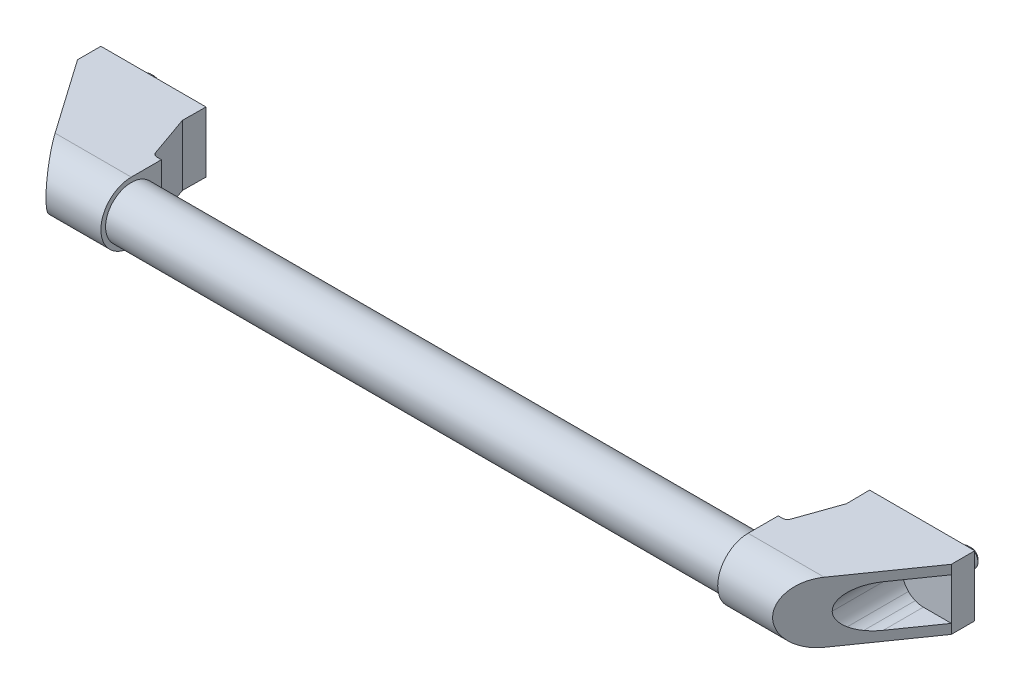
ISO-10303-21;
HEADER;
FILE_DESCRIPTION(('STEP AP214'),'2;1');
FILE_NAME('part.step','',(''),(''),'','','');
FILE_SCHEMA(('AUTOMOTIVE_DESIGN { 1 0 10303 214 1 1 1 1 }'));
ENDSEC;
DATA;
#1=APPLICATION_CONTEXT('core data for automotive mechanical design processes');
#2=APPLICATION_PROTOCOL_DEFINITION('international standard','automotive_design',2000,#1);
#3=PRODUCT_CONTEXT('',#1,'mechanical');
#4=PRODUCT('Part','Part','',(#3));
#5=PRODUCT_RELATED_PRODUCT_CATEGORY('part','',(#4));
#6=PRODUCT_DEFINITION_FORMATION('','',#4);
#7=PRODUCT_DEFINITION_CONTEXT('part definition',#1,'design');
#8=PRODUCT_DEFINITION('design','',#6,#7);
#9=PRODUCT_DEFINITION_SHAPE('','',#8);
#10=(LENGTH_UNIT() NAMED_UNIT(*) SI_UNIT(.MILLI.,.METRE.));
#11=(NAMED_UNIT(*) PLANE_ANGLE_UNIT() SI_UNIT($,.RADIAN.));
#12=(NAMED_UNIT(*) SI_UNIT($,.STERADIAN.) SOLID_ANGLE_UNIT());
#13=UNCERTAINTY_MEASURE_WITH_UNIT(LENGTH_MEASURE(1.E-05),#10,'distance_accuracy_value','');
#14=(GEOMETRIC_REPRESENTATION_CONTEXT(3) GLOBAL_UNCERTAINTY_ASSIGNED_CONTEXT((#13)) GLOBAL_UNIT_ASSIGNED_CONTEXT((#10,
#11,#12)) REPRESENTATION_CONTEXT('',''));
#15=CARTESIAN_POINT('',(0.,0.,0.));
#16=DIRECTION('',(0.,0.,1.));
#17=DIRECTION('',(1.,0.,0.));
#18=AXIS2_PLACEMENT_3D('',#15,#16,#17);
#19=CARTESIAN_POINT('',(307.,0.,42.));
#20=DIRECTION('',(1.,0.,0.));
#21=DIRECTION('',(0.,1.,0.));
#22=AXIS2_PLACEMENT_3D('',#19,#20,#21);
#23=PLANE('',#22);
#24=DIRECTION('',(0.,0.,-1.));
#25=VECTOR('',#24,1.);
#26=CARTESIAN_POINT('',(307.,13.,42.));
#27=LINE('',#26,#25);
#28=CARTESIAN_POINT('',(307.,13.,42.));
#29=VERTEX_POINT('',#28);
#30=CARTESIAN_POINT('',(307.,13.,29.1064296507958));
#31=VERTEX_POINT('',#30);
#32=EDGE_CURVE('E609',#29,#31,#27,.T.);
#33=ORIENTED_EDGE('',*,*,#32,.T.);
#34=DIRECTION('',(0.,1.,0.));
#35=VECTOR('',#34,1.);
#36=CARTESIAN_POINT('',(307.,-13.,29.1064296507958));
#37=LINE('',#36,#35);
#38=CARTESIAN_POINT('',(307.,-13.,29.1064296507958));
#39=VERTEX_POINT('',#38);
#40=EDGE_CURVE('E586',#39,#31,#37,.T.);
#41=ORIENTED_EDGE('',*,*,#40,.F.);
#42=DIRECTION('',(0.,0.,-1.));
#43=VECTOR('',#42,1.);
#44=CARTESIAN_POINT('',(307.,-13.,42.));
#45=LINE('',#44,#43);
#46=CARTESIAN_POINT('',(307.,-13.,42.));
#47=VERTEX_POINT('',#46);
#48=EDGE_CURVE('E612',#47,#39,#45,.T.);
#49=ORIENTED_EDGE('',*,*,#48,.F.);
#50=CARTESIAN_POINT('',(307.,0.,42.));
#51=DIRECTION('',(1.,0.,0.));
#52=DIRECTION('',(0.,1.,0.));
#53=AXIS2_PLACEMENT_3D('',#50,#51,#52);
#54=CIRCLE('',#53,13.);
#55=EDGE_CURVE('E615',#29,#47,#54,.T.);
#56=ORIENTED_EDGE('',*,*,#55,.F.);
#57=EDGE_LOOP('',(#33,#41,#49,#56));
#58=FACE_BOUND('',#57,.T.);
#59=CARTESIAN_POINT('',(307.,0.,42.));
#60=DIRECTION('',(1.,0.,0.));
#61=DIRECTION('',(0.,1.,0.));
#62=AXIS2_PLACEMENT_3D('',#59,#60,#61);
#63=CIRCLE('',#62,11.);
#64=CARTESIAN_POINT('',(307.,11.,42.));
#65=VERTEX_POINT('',#64);
#66=EDGE_CURVE('E9',#65,#65,#63,.F.);
#67=ORIENTED_EDGE('',*,*,#66,.F.);
#68=EDGE_LOOP('',(#67));
#69=FACE_BOUND('',#68,.T.);
#70=ADVANCED_FACE('F14',(#58,#69),#23,.F.);
#71=CARTESIAN_POINT('',(362.,13.,-1.4137996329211E-13));
#72=DIRECTION('',(0.,0.,-1.));
#73=DIRECTION('',(-1.,0.,0.));
#74=AXIS2_PLACEMENT_3D('',#71,#72,#73);
#75=PLANE('',#74);
#76=DIRECTION('',(0.,-1.,0.));
#77=VECTOR('',#76,1.);
#78=CARTESIAN_POINT('',(337.,8.,-1.25767452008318E-13));
#79=LINE('',#78,#77);
#80=CARTESIAN_POINT('',(337.,8.,-1.25767452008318E-13));
#81=VERTEX_POINT('',#80);
#82=CARTESIAN_POINT('',(337.,-8.,-1.25767452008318E-13));
#83=VERTEX_POINT('',#82);
#84=EDGE_CURVE('E496',#81,#83,#79,.T.);
#85=ORIENTED_EDGE('',*,*,#84,.F.);
#86=DIRECTION('',(-1.,0.,0.));
#87=VECTOR('',#86,1.);
#88=CARTESIAN_POINT('',(337.,8.,-1.25767452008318E-13));
#89=LINE('',#88,#87);
#90=CARTESIAN_POINT('',(322.,8.,-1.196959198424E-13));
#91=VERTEX_POINT('',#90);
#92=EDGE_CURVE('E29',#81,#91,#89,.T.);
#93=ORIENTED_EDGE('',*,*,#92,.T.);
#94=DIRECTION('',(0.,1.,0.));
#95=VECTOR('',#94,1.);
#96=CARTESIAN_POINT('',(322.,-8.,-1.196959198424E-13));
#97=LINE('',#96,#95);
#98=CARTESIAN_POINT('',(322.,-8.,-1.196959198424E-13));
#99=VERTEX_POINT('',#98);
#100=EDGE_CURVE('E490',#99,#91,#97,.T.);
#101=ORIENTED_EDGE('',*,*,#100,.F.);
#102=DIRECTION('',(1.,0.,0.));
#103=VECTOR('',#102,1.);
#104=CARTESIAN_POINT('',(322.,-8.,-1.196959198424E-13));
#105=LINE('',#104,#103);
#106=EDGE_CURVE('E493',#99,#83,#105,.T.);
#107=ORIENTED_EDGE('',*,*,#106,.T.);
#108=EDGE_LOOP('',(#85,#93,#101,#107));
#109=FACE_BOUND('',#108,.T.);
#110=DIRECTION('',(0.,1.,0.));
#111=VECTOR('',#110,1.);
#112=CARTESIAN_POINT('',(317.,-13.,-1.17961196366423E-13));
#113=LINE('',#112,#111);
#114=CARTESIAN_POINT('',(317.,-13.,-1.17961196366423E-13));
#115=VERTEX_POINT('',#114);
#116=CARTESIAN_POINT('',(317.,13.,-1.17961196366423E-13));
#117=VERTEX_POINT('',#116);
#118=EDGE_CURVE('E594',#115,#117,#113,.T.);
#119=ORIENTED_EDGE('',*,*,#118,.T.);
#120=DIRECTION('',(-1.,0.,0.));
#121=VECTOR('',#120,1.);
#122=CARTESIAN_POINT('',(362.,13.,-1.4137996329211E-13));
#123=LINE('',#122,#121);
#124=CARTESIAN_POINT('',(362.,13.,-1.4137996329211E-13));
#125=VERTEX_POINT('',#124);
#126=EDGE_CURVE('E625',#125,#117,#123,.T.);
#127=ORIENTED_EDGE('',*,*,#126,.F.);
#128=DIRECTION('',(0.,-1.,0.));
#129=VECTOR('',#128,1.);
#130=CARTESIAN_POINT('',(362.,13.,-1.4137996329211E-13));
#131=LINE('',#130,#129);
#132=CARTESIAN_POINT('',(362.,-13.,-1.4137996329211E-13));
#133=VERTEX_POINT('',#132);
#134=EDGE_CURVE('E620',#125,#133,#131,.T.);
#135=ORIENTED_EDGE('',*,*,#134,.T.);
#136=DIRECTION('',(-1.,0.,0.));
#137=VECTOR('',#136,1.);
#138=CARTESIAN_POINT('',(362.,-13.,-1.4137996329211E-13));
#139=LINE('',#138,#137);
#140=EDGE_CURVE('E628',#133,#115,#139,.T.);
#141=ORIENTED_EDGE('',*,*,#140,.T.);
#142=EDGE_LOOP('',(#119,#127,#135,#141));
#143=FACE_BOUND('',#142,.T.);
#144=CARTESIAN_POINT('',(350.,0.,-1.34441069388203E-13));
#145=DIRECTION('',(0.,0.,1.));
#146=DIRECTION('',(1.,0.,0.));
#147=AXIS2_PLACEMENT_3D('',#144,#145,#146);
#148=CIRCLE('',#147,4.);
#149=CARTESIAN_POINT('',(354.,0.,-1.36009259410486E-13));
#150=VERTEX_POINT('',#149);
#151=EDGE_CURVE('E480',#150,#150,#148,.T.);
#152=ORIENTED_EDGE('',*,*,#151,.T.);
#153=EDGE_LOOP('',(#152));
#154=FACE_BOUND('',#153,.T.);
#155=ADVANCED_FACE('F693',(#109,#143,#154),#75,.T.);
#156=CARTESIAN_POINT('',(362.,-13.,9.99999999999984));
#157=DIRECTION('',(-0.819152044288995,0.,-0.573576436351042));
#158=DIRECTION('',(-0.573576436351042,0.,0.819152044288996));
#159=AXIS2_PLACEMENT_3D('',#156,#157,#158);
#160=PLANE('',#159);
#161=DIRECTION('',(0.573576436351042,0.,-0.819152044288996));
#162=VECTOR('',#161,1.);
#163=CARTESIAN_POINT('',(362.,-8.90119415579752,9.99999999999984));
#164=LINE('',#163,#162);
#165=CARTESIAN_POINT('',(349.999992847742,-8.90119415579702,27.1377862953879));
#166=VERTEX_POINT('',#165);
#167=CARTESIAN_POINT('',(362.,-8.90119415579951,9.99999999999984));
#168=VERTEX_POINT('',#167);
#169=EDGE_CURVE('E22',#166,#168,#164,.T.);
#170=ORIENTED_EDGE('',*,*,#169,.F.);
#171=CARTESIAN_POINT('',(349.999999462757,0.0988421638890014,27.1377768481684));
#172=DIRECTION('',(-0.819152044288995,0.,-0.573576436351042));
#173=DIRECTION('',(-0.573576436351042,0.,0.819152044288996));
#174=AXIS2_PLACEMENT_3D('',#171,#172,#173);
#175=ELLIPSE('',#174,15.6910844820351,9.00003631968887);
#176=CARTESIAN_POINT('',(346.555841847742,-8.21611015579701,32.0565436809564));
#177=VERTEX_POINT('',#176);
#178=EDGE_CURVE('E653',#166,#177,#175,.T.);
#179=ORIENTED_EDGE('',*,*,#178,.T.);
#180=CARTESIAN_POINT('',(350.000013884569,0.0988360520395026,27.1377562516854));
#181=DIRECTION('',(-0.819152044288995,0.,-0.573576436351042));
#182=DIRECTION('',(-0.573576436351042,0.,0.819152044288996));
#183=AXIS2_PLACEMENT_3D('',#180,#181,#182);
#184=ELLIPSE('',#183,15.6910842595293,9.00003619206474);
#185=CARTESIAN_POINT('',(343.636031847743,-6.26515515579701,36.2264645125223));
#186=VERTEX_POINT('',#185);
#187=EDGE_CURVE('E650',#177,#186,#184,.T.);
#188=ORIENTED_EDGE('',*,*,#187,.T.);
#189=CARTESIAN_POINT('',(350.000032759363,0.0988180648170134,27.1377292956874));
#190=DIRECTION('',(-0.819152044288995,0.,-0.573576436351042));
#191=DIRECTION('',(-0.573576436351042,0.,0.819152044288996));
#192=AXIS2_PLACEMENT_3D('',#189,#190,#191);
#193=ELLIPSE('',#192,15.6910853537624,9.00003681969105);
#194=CARTESIAN_POINT('',(340.999995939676,0.0988089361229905,39.9911139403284));
#195=VERTEX_POINT('',#194);
#196=EDGE_CURVE('E647',#186,#195,#193,.T.);
#197=ORIENTED_EDGE('',*,*,#196,.T.);
#198=CARTESIAN_POINT('',(350.000030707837,0.098790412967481,27.1377322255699));
#199=DIRECTION('',(-0.819152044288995,0.,-0.573576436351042));
#200=DIRECTION('',(-0.573576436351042,0.,0.819152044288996));
#201=AXIS2_PLACEMENT_3D('',#198,#199,#200);
#202=ELLIPSE('',#201,15.6910817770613,9.00003476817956);
#203=CARTESIAN_POINT('',(343.636039,6.4627699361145,36.2264542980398));
#204=VERTEX_POINT('',#203);
#205=EDGE_CURVE('E644',#195,#204,#202,.T.);
#206=ORIENTED_EDGE('',*,*,#205,.T.);
#207=CARTESIAN_POINT('',(350.000021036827,0.0987787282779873,27.1377460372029));
#208=DIRECTION('',(-0.819152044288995,0.,-0.573576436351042));
#209=DIRECTION('',(-0.573576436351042,0.,0.819152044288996));
#210=AXIS2_PLACEMENT_3D('',#207,#208,#209);
#211=ELLIPSE('',#210,15.6910842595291,9.00003619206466);
#212=CARTESIAN_POINT('',(346.555849,8.4137249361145,32.0565334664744));
#213=VERTEX_POINT('',#212);
#214=EDGE_CURVE('E641',#204,#213,#211,.T.);
#215=ORIENTED_EDGE('',*,*,#214,.T.);
#216=CARTESIAN_POINT('',(350.000006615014,0.098772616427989,27.1377666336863));
#217=DIRECTION('',(-0.819152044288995,0.,-0.573576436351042));
#218=DIRECTION('',(-0.573576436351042,0.,0.819152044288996));
#219=AXIS2_PLACEMENT_3D('',#216,#217,#218);
#220=ELLIPSE('',#219,15.691084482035,9.0000363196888);
#221=CARTESIAN_POINT('',(350.,9.09880893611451,27.1377760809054));
#222=VERTEX_POINT('',#221);
#223=EDGE_CURVE('E638',#213,#222,#220,.T.);
#224=ORIENTED_EDGE('',*,*,#223,.T.);
#225=DIRECTION('',(0.573576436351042,0.,-0.819152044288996));
#226=VECTOR('',#225,1.);
#227=CARTESIAN_POINT('',(362.,9.09880893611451,9.99999999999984));
#228=LINE('',#227,#226);
#229=CARTESIAN_POINT('',(362.,9.09880893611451,9.99999999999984));
#230=VERTEX_POINT('',#229);
#231=EDGE_CURVE('E635',#222,#230,#228,.T.);
#232=ORIENTED_EDGE('',*,*,#231,.T.);
#233=DIRECTION('',(0.,1.,0.));
#234=VECTOR('',#233,1.);
#235=CARTESIAN_POINT('',(362.,-13.,9.99999999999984));
#236=LINE('',#235,#234);
#237=CARTESIAN_POINT('',(362.,13.,9.99999999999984));
#238=VERTEX_POINT('',#237);
#239=EDGE_CURVE('E603',#230,#238,#236,.T.);
#240=ORIENTED_EDGE('',*,*,#239,.T.);
#241=DIRECTION('',(-0.573576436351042,0.,0.819152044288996));
#242=VECTOR('',#241,1.);
#243=CARTESIAN_POINT('',(362.,13.,9.99999999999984));
#244=LINE('',#243,#242);
#245=CARTESIAN_POINT('',(339.593358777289,13.,42.));
#246=VERTEX_POINT('',#245);
#247=EDGE_CURVE('E597',#238,#246,#244,.T.);
#248=ORIENTED_EDGE('',*,*,#247,.T.);
#249=CARTESIAN_POINT('',(339.593358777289,0.,42.));
#250=DIRECTION('',(-0.819152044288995,0.,-0.573576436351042));
#251=DIRECTION('',(-0.573576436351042,0.,0.819152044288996));
#252=AXIS2_PLACEMENT_3D('',#249,#250,#251);
#253=ELLIPSE('',#252,15.8700696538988,13.);
#254=CARTESIAN_POINT('',(339.593358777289,-13.,42.));
#255=VERTEX_POINT('',#254);
#256=EDGE_CURVE('E607',#255,#246,#253,.T.);
#257=ORIENTED_EDGE('',*,*,#256,.F.);
#258=DIRECTION('',(-0.573576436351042,0.,0.819152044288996));
#259=VECTOR('',#258,1.);
#260=CARTESIAN_POINT('',(362.,-13.,9.99999999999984));
#261=LINE('',#260,#259);
#262=CARTESIAN_POINT('',(362.,-13.,9.99999999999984));
#263=VERTEX_POINT('',#262);
#264=EDGE_CURVE('E600',#263,#255,#261,.T.);
#265=ORIENTED_EDGE('',*,*,#264,.F.);
#266=EDGE_CURVE('E604',#263,#168,#236,.T.);
#267=ORIENTED_EDGE('',*,*,#266,.T.);
#268=EDGE_LOOP('',(#170,#179,#188,#197,#206,#215,#224,#232,#240,#248,#257,#265,#267));
#269=FACE_BOUND('',#268,.T.);
#270=ADVANCED_FACE('F666',(#269),#160,.F.);
#271=CARTESIAN_POINT('',(362.,13.,42.));
#272=DIRECTION('',(0.,1.,0.));
#273=DIRECTION('',(-1.,0.,0.));
#274=AXIS2_PLACEMENT_3D('',#271,#272,#273);
#275=PLANE('',#274);
#276=DIRECTION('',(-0.0104830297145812,0.,-0.999945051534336));
#277=VECTOR('',#276,1.);
#278=CARTESIAN_POINT('',(317.104830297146,13.,9.99945051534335));
#279=LINE('',#278,#277);
#280=CARTESIAN_POINT('',(317.104830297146,13.,9.99945051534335));
#281=VERTEX_POINT('',#280);
#282=EDGE_CURVE('E572',#281,#117,#279,.T.);
#283=ORIENTED_EDGE('',*,*,#282,.F.);
#284=DIRECTION('',(-0.332150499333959,0.,0.943226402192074));
#285=VECTOR('',#284,1.);
#286=CARTESIAN_POINT('',(317.104830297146,13.,9.99945051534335));
#287=LINE('',#286,#285);
#288=CARTESIAN_POINT('',(310.854102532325,13.,27.7499927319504));
#289=VERTEX_POINT('',#288);
#290=EDGE_CURVE('E569',#281,#289,#287,.T.);
#291=ORIENTED_EDGE('',*,*,#290,.T.);
#292=CARTESIAN_POINT('',(308.967649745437,13.,27.0856916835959));
#293=DIRECTION('',(0.,1.,0.));
#294=DIRECTION('',(-1.,0.,0.));
#295=AXIS2_PLACEMENT_3D('',#292,#293,#294);
#296=CIRCLE('',#295,2.);
#297=CARTESIAN_POINT('',(308.988615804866,13.,29.0855817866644));
#298=VERTEX_POINT('',#297);
#299=EDGE_CURVE('E566',#298,#289,#296,.T.);
#300=ORIENTED_EDGE('',*,*,#299,.F.);
#301=DIRECTION('',(0.999945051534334,0.,-0.0104830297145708));
#302=VECTOR('',#301,1.);
#303=CARTESIAN_POINT('',(307.,13.,29.1064296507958));
#304=LINE('',#303,#302);
#305=EDGE_CURVE('E563',#31,#298,#304,.T.);
#306=ORIENTED_EDGE('',*,*,#305,.F.);
#307=ORIENTED_EDGE('',*,*,#32,.F.);
#308=DIRECTION('',(-1.,0.,0.));
#309=VECTOR('',#308,1.);
#310=CARTESIAN_POINT('',(362.,13.,42.));
#311=LINE('',#310,#309);
#312=EDGE_CURVE('E633',#246,#29,#311,.T.);
#313=ORIENTED_EDGE('',*,*,#312,.F.);
#314=ORIENTED_EDGE('',*,*,#247,.F.);
#315=DIRECTION('',(0.,0.,-1.));
#316=VECTOR('',#315,1.);
#317=CARTESIAN_POINT('',(362.,13.,42.));
#318=LINE('',#317,#316);
#319=EDGE_CURVE('E618',#238,#125,#318,.T.);
#320=ORIENTED_EDGE('',*,*,#319,.T.);
#321=ORIENTED_EDGE('',*,*,#126,.T.);
#322=EDGE_LOOP('',(#283,#291,#300,#306,#307,#313,#314,#320,#321));
#323=FACE_BOUND('',#322,.T.);
#324=ADVANCED_FACE('F700',(#323),#275,.T.);
#325=CARTESIAN_POINT('',(362.,0.,42.));
#326=DIRECTION('',(-1.,0.,0.));
#327=DIRECTION('',(0.,-1.,0.));
#328=AXIS2_PLACEMENT_3D('',#325,#326,#327);
#329=CYLINDRICAL_SURFACE('',#328,13.);
#330=ORIENTED_EDGE('',*,*,#256,.T.);
#331=ORIENTED_EDGE('',*,*,#312,.T.);
#332=ORIENTED_EDGE('',*,*,#55,.T.);
#333=DIRECTION('',(-1.,0.,0.));
#334=VECTOR('',#333,1.);
#335=CARTESIAN_POINT('',(362.,-13.,42.));
#336=LINE('',#335,#334);
#337=EDGE_CURVE('E631',#255,#47,#336,.T.);
#338=ORIENTED_EDGE('',*,*,#337,.F.);
#339=EDGE_LOOP('',(#330,#331,#332,#338));
#340=FACE_BOUND('',#339,.T.);
#341=ADVANCED_FACE('F16',(#340),#329,.T.);
#342=CARTESIAN_POINT('',(362.,-13.,42.));
#343=DIRECTION('',(0.,1.,0.));
#344=DIRECTION('',(-1.,0.,0.));
#345=AXIS2_PLACEMENT_3D('',#342,#343,#344);
#346=PLANE('',#345);
#347=DIRECTION('',(-0.332150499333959,0.,0.943226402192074));
#348=VECTOR('',#347,1.);
#349=CARTESIAN_POINT('',(317.104830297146,-13.,9.99945051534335));
#350=LINE('',#349,#348);
#351=CARTESIAN_POINT('',(317.104830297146,-13.,9.99945051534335));
#352=VERTEX_POINT('',#351);
#353=CARTESIAN_POINT('',(310.854102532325,-13.,27.7499927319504));
#354=VERTEX_POINT('',#353);
#355=EDGE_CURVE('E580',#352,#354,#350,.T.);
#356=ORIENTED_EDGE('',*,*,#355,.F.);
#357=DIRECTION('',(-0.0104830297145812,0.,-0.999945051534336));
#358=VECTOR('',#357,1.);
#359=CARTESIAN_POINT('',(317.104830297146,-13.,9.99945051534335));
#360=LINE('',#359,#358);
#361=EDGE_CURVE('E583',#352,#115,#360,.T.);
#362=ORIENTED_EDGE('',*,*,#361,.T.);
#363=ORIENTED_EDGE('',*,*,#140,.F.);
#364=DIRECTION('',(0.,0.,-1.));
#365=VECTOR('',#364,1.);
#366=CARTESIAN_POINT('',(362.,-13.,42.));
#367=LINE('',#366,#365);
#368=EDGE_CURVE('E623',#263,#133,#367,.T.);
#369=ORIENTED_EDGE('',*,*,#368,.F.);
#370=ORIENTED_EDGE('',*,*,#264,.T.);
#371=ORIENTED_EDGE('',*,*,#337,.T.);
#372=ORIENTED_EDGE('',*,*,#48,.T.);
#373=DIRECTION('',(0.999945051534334,0.,-0.0104830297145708));
#374=VECTOR('',#373,1.);
#375=CARTESIAN_POINT('',(307.,-13.,29.1064296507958));
#376=LINE('',#375,#374);
#377=CARTESIAN_POINT('',(308.988615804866,-13.,29.0855817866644));
#378=VERTEX_POINT('',#377);
#379=EDGE_CURVE('E574',#39,#378,#376,.T.);
#380=ORIENTED_EDGE('',*,*,#379,.T.);
#381=CARTESIAN_POINT('',(308.967649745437,-13.,27.0856916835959));
#382=DIRECTION('',(0.,1.,0.));
#383=DIRECTION('',(-1.,0.,0.));
#384=AXIS2_PLACEMENT_3D('',#381,#382,#383);
#385=CIRCLE('',#384,2.);
#386=EDGE_CURVE('E577',#378,#354,#385,.T.);
#387=ORIENTED_EDGE('',*,*,#386,.T.);
#388=EDGE_LOOP('',(#356,#362,#363,#369,#370,#371,#372,#380,#387));
#389=FACE_BOUND('',#388,.T.);
#390=ADVANCED_FACE('F670',(#389),#346,.F.);
#391=CARTESIAN_POINT('',(362.,0.,42.));
#392=DIRECTION('',(1.,0.,0.));
#393=DIRECTION('',(0.,1.,0.));
#394=AXIS2_PLACEMENT_3D('',#391,#392,#393);
#395=PLANE('',#394);
#396=ORIENTED_EDGE('',*,*,#266,.F.);
#397=ORIENTED_EDGE('',*,*,#368,.T.);
#398=ORIENTED_EDGE('',*,*,#134,.F.);
#399=ORIENTED_EDGE('',*,*,#319,.F.);
#400=ORIENTED_EDGE('',*,*,#239,.F.);
#401=DIRECTION('',(0.,1.,0.));
#402=VECTOR('',#401,1.);
#403=CARTESIAN_POINT('',(362.,-8.90119415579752,9.99999999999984));
#404=LINE('',#403,#402);
#405=EDGE_CURVE('E540',#168,#230,#404,.T.);
#406=ORIENTED_EDGE('',*,*,#405,.F.);
#407=EDGE_LOOP('',(#396,#397,#398,#399,#400,#406));
#408=FACE_BOUND('',#407,.T.);
#409=ADVANCED_FACE('F663',(#408),#395,.T.);
#410=CARTESIAN_POINT('',(317.104830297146,-13.,9.99945051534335));
#411=DIRECTION('',(0.999945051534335,0.,-0.0104830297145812));
#412=DIRECTION('',(-0.0104830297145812,0.,-0.999945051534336));
#413=AXIS2_PLACEMENT_3D('',#410,#411,#412);
#414=PLANE('',#413);
#415=DIRECTION('',(0.,1.,0.));
#416=VECTOR('',#415,1.);
#417=CARTESIAN_POINT('',(317.104830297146,-13.,9.99945051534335));
#418=LINE('',#417,#416);
#419=EDGE_CURVE('E592',#352,#281,#418,.T.);
#420=ORIENTED_EDGE('',*,*,#419,.T.);
#421=ORIENTED_EDGE('',*,*,#282,.T.);
#422=ORIENTED_EDGE('',*,*,#118,.F.);
#423=ORIENTED_EDGE('',*,*,#361,.F.);
#424=EDGE_LOOP('',(#420,#421,#422,#423));
#425=FACE_BOUND('',#424,.T.);
#426=ADVANCED_FACE('F735',(#425),#414,.F.);
#427=CARTESIAN_POINT('',(317.104830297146,-13.,9.99945051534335));
#428=DIRECTION('',(-0.943226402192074,0.,-0.332150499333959));
#429=DIRECTION('',(-0.332150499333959,0.,0.943226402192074));
#430=AXIS2_PLACEMENT_3D('',#427,#428,#429);
#431=PLANE('',#430);
#432=DIRECTION('',(0.,1.,0.));
#433=VECTOR('',#432,1.);
#434=CARTESIAN_POINT('',(310.854102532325,-13.,27.7499927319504));
#435=LINE('',#434,#433);
#436=EDGE_CURVE('E590',#354,#289,#435,.T.);
#437=ORIENTED_EDGE('',*,*,#436,.T.);
#438=ORIENTED_EDGE('',*,*,#290,.F.);
#439=ORIENTED_EDGE('',*,*,#419,.F.);
#440=ORIENTED_EDGE('',*,*,#355,.T.);
#441=EDGE_LOOP('',(#437,#438,#439,#440));
#442=FACE_BOUND('',#441,.T.);
#443=ADVANCED_FACE('F689',(#442),#431,.T.);
#444=CARTESIAN_POINT('',(308.967649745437,-13.,27.0856916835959));
#445=DIRECTION('',(0.,1.,0.));
#446=DIRECTION('',(-1.,0.,0.));
#447=AXIS2_PLACEMENT_3D('',#444,#445,#446);
#448=CYLINDRICAL_SURFACE('',#447,2.);
#449=DIRECTION('',(0.,1.,0.));
#450=VECTOR('',#449,1.);
#451=CARTESIAN_POINT('',(308.988615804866,-13.,29.0855817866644));
#452=LINE('',#451,#450);
#453=EDGE_CURVE('E588',#378,#298,#452,.T.);
#454=ORIENTED_EDGE('',*,*,#453,.T.);
#455=ORIENTED_EDGE('',*,*,#299,.T.);
#456=ORIENTED_EDGE('',*,*,#436,.F.);
#457=ORIENTED_EDGE('',*,*,#386,.F.);
#458=EDGE_LOOP('',(#454,#455,#456,#457));
#459=FACE_BOUND('',#458,.T.);
#460=ADVANCED_FACE('F686',(#459),#448,.F.);
#461=CARTESIAN_POINT('',(307.,-13.,29.1064296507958));
#462=DIRECTION('',(0.0104830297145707,0.,0.999945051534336));
#463=DIRECTION('',(0.999945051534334,0.,-0.0104830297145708));
#464=AXIS2_PLACEMENT_3D('',#461,#462,#463);
#465=PLANE('',#464);
#466=ORIENTED_EDGE('',*,*,#40,.T.);
#467=ORIENTED_EDGE('',*,*,#305,.T.);
#468=ORIENTED_EDGE('',*,*,#453,.F.);
#469=ORIENTED_EDGE('',*,*,#379,.F.);
#470=EDGE_LOOP('',(#466,#467,#468,#469));
#471=FACE_BOUND('',#470,.T.);
#472=ADVANCED_FACE('F682',(#471),#465,.F.);
#473=CARTESIAN_POINT('',(362.,-8.90119415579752,9.99999999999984));
#474=DIRECTION('',(0.,1.,0.));
#475=DIRECTION('',(-1.,0.,0.));
#476=AXIS2_PLACEMENT_3D('',#473,#474,#475);
#477=PLANE('',#476);
#478=ORIENTED_EDGE('',*,*,#169,.T.);
#479=DIRECTION('',(-1.,0.,0.));
#480=VECTOR('',#479,1.);
#481=CARTESIAN_POINT('',(362.,-8.90119415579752,9.99999999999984));
#482=LINE('',#481,#480);
#483=CARTESIAN_POINT('',(349.999992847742,-8.90119415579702,9.99999999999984));
#484=VERTEX_POINT('',#483);
#485=EDGE_CURVE('E37',#168,#484,#482,.T.);
#486=ORIENTED_EDGE('',*,*,#485,.T.);
#487=DIRECTION('',(0.,0.,1.));
#488=VECTOR('',#487,1.);
#489=CARTESIAN_POINT('',(349.999992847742,-8.90119415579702,9.99999999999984));
#490=LINE('',#489,#488);
#491=EDGE_CURVE('E560',#484,#166,#490,.T.);
#492=ORIENTED_EDGE('',*,*,#491,.T.);
#493=EDGE_LOOP('',(#478,#486,#492));
#494=FACE_BOUND('',#493,.T.);
#495=ADVANCED_FACE('F658',(#494),#477,.T.);
#496=CARTESIAN_POINT('',(349.999999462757,0.0988421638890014,9.99999999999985));
#497=DIRECTION('',(0.,0.,1.));
#498=DIRECTION('',(1.,0.,0.));
#499=AXIS2_PLACEMENT_3D('',#496,#497,#498);
#500=CYLINDRICAL_SURFACE('',#499,9.00003631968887);
#501=ORIENTED_EDGE('',*,*,#491,.F.);
#502=CARTESIAN_POINT('',(349.999999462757,0.0988421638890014,9.99999999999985));
#503=DIRECTION('',(0.,0.,1.));
#504=DIRECTION('',(1.,0.,0.));
#505=AXIS2_PLACEMENT_3D('',#502,#503,#504);
#506=CIRCLE('',#505,9.00003631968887);
#507=CARTESIAN_POINT('',(346.555841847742,-8.21611015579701,9.99999999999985));
#508=VERTEX_POINT('',#507);
#509=EDGE_CURVE('E520',#508,#484,#506,.T.);
#510=ORIENTED_EDGE('',*,*,#509,.F.);
#511=DIRECTION('',(0.,0.,1.));
#512=VECTOR('',#511,1.);
#513=CARTESIAN_POINT('',(346.555841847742,-8.21611015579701,9.99999999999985));
#514=LINE('',#513,#512);
#515=EDGE_CURVE('E557',#508,#177,#514,.T.);
#516=ORIENTED_EDGE('',*,*,#515,.T.);
#517=ORIENTED_EDGE('',*,*,#178,.F.);
#518=EDGE_LOOP('',(#501,#510,#516,#517));
#519=FACE_BOUND('',#518,.T.);
#520=ADVANCED_FACE('F812',(#519),#500,.F.);
#521=CARTESIAN_POINT('',(350.000013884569,0.0988360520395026,9.99999999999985));
#522=DIRECTION('',(0.,0.,1.));
#523=DIRECTION('',(1.,0.,0.));
#524=AXIS2_PLACEMENT_3D('',#521,#522,#523);
#525=CYLINDRICAL_SURFACE('',#524,9.00003619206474);
#526=ORIENTED_EDGE('',*,*,#515,.F.);
#527=CARTESIAN_POINT('',(350.000013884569,0.0988360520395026,9.99999999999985));
#528=DIRECTION('',(0.,0.,1.));
#529=DIRECTION('',(1.,0.,0.));
#530=AXIS2_PLACEMENT_3D('',#527,#528,#529);
#531=CIRCLE('',#530,9.00003619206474);
#532=CARTESIAN_POINT('',(343.636031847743,-6.26515515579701,9.99999999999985));
#533=VERTEX_POINT('',#532);
#534=EDGE_CURVE('E522',#533,#508,#531,.T.);
#535=ORIENTED_EDGE('',*,*,#534,.F.);
#536=DIRECTION('',(0.,0.,1.));
#537=VECTOR('',#536,1.);
#538=CARTESIAN_POINT('',(343.636031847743,-6.26515515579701,9.99999999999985));
#539=LINE('',#538,#537);
#540=EDGE_CURVE('E554',#533,#186,#539,.T.);
#541=ORIENTED_EDGE('',*,*,#540,.T.);
#542=ORIENTED_EDGE('',*,*,#187,.F.);
#543=EDGE_LOOP('',(#526,#535,#541,#542));
#544=FACE_BOUND('',#543,.T.);
#545=ADVANCED_FACE('F819',(#544),#525,.F.);
#546=CARTESIAN_POINT('',(350.000032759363,0.0988180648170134,9.99999999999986));
#547=DIRECTION('',(0.,0.,1.));
#548=DIRECTION('',(1.,0.,0.));
#549=AXIS2_PLACEMENT_3D('',#546,#547,#548);
#550=CYLINDRICAL_SURFACE('',#549,9.00003681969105);
#551=ORIENTED_EDGE('',*,*,#540,.F.);
#552=CARTESIAN_POINT('',(350.000032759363,0.0988180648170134,9.99999999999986));
#553=DIRECTION('',(0.,0.,1.));
#554=DIRECTION('',(1.,0.,0.));
#555=AXIS2_PLACEMENT_3D('',#552,#553,#554);
#556=CIRCLE('',#555,9.00003681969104);
#557=CARTESIAN_POINT('',(340.999995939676,0.0988089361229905,9.99999999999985));
#558=VERTEX_POINT('',#557);
#559=EDGE_CURVE('E525',#558,#533,#556,.T.);
#560=ORIENTED_EDGE('',*,*,#559,.F.);
#561=DIRECTION('',(0.,0.,1.));
#562=VECTOR('',#561,1.);
#563=CARTESIAN_POINT('',(340.999995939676,0.0988089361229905,9.99999999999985));
#564=LINE('',#563,#562);
#565=EDGE_CURVE('E551',#558,#195,#564,.T.);
#566=ORIENTED_EDGE('',*,*,#565,.T.);
#567=ORIENTED_EDGE('',*,*,#196,.F.);
#568=EDGE_LOOP('',(#551,#560,#566,#567));
#569=FACE_BOUND('',#568,.T.);
#570=ADVANCED_FACE('F828',(#569),#550,.F.);
#571=CARTESIAN_POINT('',(350.000030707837,0.098790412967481,9.99999999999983));
#572=DIRECTION('',(0.,0.,1.));
#573=DIRECTION('',(1.,0.,0.));
#574=AXIS2_PLACEMENT_3D('',#571,#572,#573);
#575=CYLINDRICAL_SURFACE('',#574,9.00003476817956);
#576=ORIENTED_EDGE('',*,*,#565,.F.);
#577=CARTESIAN_POINT('',(350.000030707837,0.098790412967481,9.99999999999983));
#578=DIRECTION('',(0.,0.,1.));
#579=DIRECTION('',(1.,0.,0.));
#580=AXIS2_PLACEMENT_3D('',#577,#578,#579);
#581=CIRCLE('',#580,9.00003476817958);
#582=CARTESIAN_POINT('',(343.636039,6.4627699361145,9.99999999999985));
#583=VERTEX_POINT('',#582);
#584=EDGE_CURVE('E528',#583,#558,#581,.T.);
#585=ORIENTED_EDGE('',*,*,#584,.F.);
#586=DIRECTION('',(0.,0.,1.));
#587=VECTOR('',#586,1.);
#588=CARTESIAN_POINT('',(343.636039,6.4627699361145,9.99999999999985));
#589=LINE('',#588,#587);
#590=EDGE_CURVE('E548',#583,#204,#589,.T.);
#591=ORIENTED_EDGE('',*,*,#590,.T.);
#592=ORIENTED_EDGE('',*,*,#205,.F.);
#593=EDGE_LOOP('',(#576,#585,#591,#592));
#594=FACE_BOUND('',#593,.T.);
#595=ADVANCED_FACE('F837',(#594),#575,.F.);
#596=CARTESIAN_POINT('',(350.000021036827,0.0987787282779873,9.99999999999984));
#597=DIRECTION('',(0.,0.,1.));
#598=DIRECTION('',(1.,0.,0.));
#599=AXIS2_PLACEMENT_3D('',#596,#597,#598);
#600=CYLINDRICAL_SURFACE('',#599,9.00003619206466);
#601=ORIENTED_EDGE('',*,*,#590,.F.);
#602=CARTESIAN_POINT('',(350.000021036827,0.0987787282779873,9.99999999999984));
#603=DIRECTION('',(0.,0.,1.));
#604=DIRECTION('',(1.,0.,0.));
#605=AXIS2_PLACEMENT_3D('',#602,#603,#604);
#606=CIRCLE('',#605,9.00003619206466);
#607=CARTESIAN_POINT('',(346.555849,8.4137249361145,9.99999999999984));
#608=VERTEX_POINT('',#607);
#609=EDGE_CURVE('E531',#608,#583,#606,.T.);
#610=ORIENTED_EDGE('',*,*,#609,.F.);
#611=DIRECTION('',(0.,0.,1.));
#612=VECTOR('',#611,1.);
#613=CARTESIAN_POINT('',(346.555849,8.4137249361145,9.99999999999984));
#614=LINE('',#613,#612);
#615=EDGE_CURVE('E545',#608,#213,#614,.T.);
#616=ORIENTED_EDGE('',*,*,#615,.T.);
#617=ORIENTED_EDGE('',*,*,#214,.F.);
#618=EDGE_LOOP('',(#601,#610,#616,#617));
#619=FACE_BOUND('',#618,.T.);
#620=ADVANCED_FACE('F846',(#619),#600,.F.);
#621=CARTESIAN_POINT('',(350.000006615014,0.098772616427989,9.99999999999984));
#622=DIRECTION('',(0.,0.,1.));
#623=DIRECTION('',(1.,0.,0.));
#624=AXIS2_PLACEMENT_3D('',#621,#622,#623);
#625=CYLINDRICAL_SURFACE('',#624,9.0000363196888);
#626=ORIENTED_EDGE('',*,*,#615,.F.);
#627=CARTESIAN_POINT('',(350.000006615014,0.098772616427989,9.99999999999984));
#628=DIRECTION('',(0.,0.,1.));
#629=DIRECTION('',(1.,0.,0.));
#630=AXIS2_PLACEMENT_3D('',#627,#628,#629);
#631=CIRCLE('',#630,9.0000363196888);
#632=CARTESIAN_POINT('',(350.,9.09880893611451,9.99999999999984));
#633=VERTEX_POINT('',#632);
#634=EDGE_CURVE('E534',#633,#608,#631,.T.);
#635=ORIENTED_EDGE('',*,*,#634,.F.);
#636=DIRECTION('',(0.,0.,1.));
#637=VECTOR('',#636,1.);
#638=CARTESIAN_POINT('',(350.,9.09880893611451,9.99999999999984));
#639=LINE('',#638,#637);
#640=EDGE_CURVE('E542',#633,#222,#639,.T.);
#641=ORIENTED_EDGE('',*,*,#640,.T.);
#642=ORIENTED_EDGE('',*,*,#223,.F.);
#643=EDGE_LOOP('',(#626,#635,#641,#642));
#644=FACE_BOUND('',#643,.T.);
#645=ADVANCED_FACE('F705',(#644),#625,.F.);
#646=CARTESIAN_POINT('',(362.,9.09880893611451,9.99999999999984));
#647=DIRECTION('',(0.,1.,0.));
#648=DIRECTION('',(-1.,0.,0.));
#649=AXIS2_PLACEMENT_3D('',#646,#647,#648);
#650=PLANE('',#649);
#651=ORIENTED_EDGE('',*,*,#640,.F.);
#652=DIRECTION('',(-1.,0.,0.));
#653=VECTOR('',#652,1.);
#654=CARTESIAN_POINT('',(362.,9.09880893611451,9.99999999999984));
#655=LINE('',#654,#653);
#656=EDGE_CURVE('E537',#230,#633,#655,.T.);
#657=ORIENTED_EDGE('',*,*,#656,.F.);
#658=ORIENTED_EDGE('',*,*,#231,.F.);
#659=EDGE_LOOP('',(#651,#657,#658));
#660=FACE_BOUND('',#659,.T.);
#661=ADVANCED_FACE('F702',(#660),#650,.F.);
#662=CARTESIAN_POINT('',(349.999999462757,0.0988421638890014,9.99999999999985));
#663=DIRECTION('',(0.,0.,1.));
#664=DIRECTION('',(1.,0.,0.));
#665=AXIS2_PLACEMENT_3D('',#662,#663,#664);
#666=PLANE('',#665);
#667=ORIENTED_EDGE('',*,*,#485,.F.);
#668=ORIENTED_EDGE('',*,*,#405,.T.);
#669=ORIENTED_EDGE('',*,*,#656,.T.);
#670=ORIENTED_EDGE('',*,*,#634,.T.);
#671=ORIENTED_EDGE('',*,*,#609,.T.);
#672=ORIENTED_EDGE('',*,*,#584,.T.);
#673=ORIENTED_EDGE('',*,*,#559,.T.);
#674=ORIENTED_EDGE('',*,*,#534,.T.);
#675=ORIENTED_EDGE('',*,*,#509,.T.);
#676=EDGE_LOOP('',(#667,#668,#669,#670,#671,#672,#673,#674,#675));
#677=FACE_BOUND('',#676,.T.);
#678=ADVANCED_FACE('F707',(#677),#666,.T.);
#679=CARTESIAN_POINT('',(337.,8.,30.));
#680=DIRECTION('',(0.,-1.,0.));
#681=DIRECTION('',(1.,0.,0.));
#682=AXIS2_PLACEMENT_3D('',#679,#680,#681);
#683=PLANE('',#682);
#684=DIRECTION('',(0.,0.,-1.));
#685=VECTOR('',#684,1.);
#686=CARTESIAN_POINT('',(322.,8.,30.));
#687=LINE('',#686,#685);
#688=CARTESIAN_POINT('',(322.,8.,30.));
#689=VERTEX_POINT('',#688);
#690=EDGE_CURVE('E517',#689,#91,#687,.T.);
#691=ORIENTED_EDGE('',*,*,#690,.T.);
#692=ORIENTED_EDGE('',*,*,#92,.F.);
#693=DIRECTION('',(0.,0.,-1.));
#694=VECTOR('',#693,1.);
#695=CARTESIAN_POINT('',(337.,8.,30.));
#696=LINE('',#695,#694);
#697=CARTESIAN_POINT('',(337.,8.,30.));
#698=VERTEX_POINT('',#697);
#699=EDGE_CURVE('E511',#698,#81,#696,.T.);
#700=ORIENTED_EDGE('',*,*,#699,.F.);
#701=DIRECTION('',(-1.,0.,0.));
#702=VECTOR('',#701,1.);
#703=CARTESIAN_POINT('',(337.,8.,30.));
#704=LINE('',#703,#702);
#705=EDGE_CURVE('E499',#698,#689,#704,.T.);
#706=ORIENTED_EDGE('',*,*,#705,.T.);
#707=EDGE_LOOP('',(#691,#692,#700,#706));
#708=FACE_BOUND('',#707,.T.);
#709=ADVANCED_FACE('F709',(#708),#683,.T.);
#710=CARTESIAN_POINT('',(322.,-8.,30.));
#711=DIRECTION('',(-1.,0.,0.));
#712=DIRECTION('',(0.,-1.,0.));
#713=AXIS2_PLACEMENT_3D('',#710,#711,#712);
#714=PLANE('',#713);
#715=DIRECTION('',(0.,0.,-1.));
#716=VECTOR('',#715,1.);
#717=CARTESIAN_POINT('',(322.,-8.,30.));
#718=LINE('',#717,#716);
#719=CARTESIAN_POINT('',(322.,-8.,30.));
#720=VERTEX_POINT('',#719);
#721=EDGE_CURVE('E515',#720,#99,#718,.T.);
#722=ORIENTED_EDGE('',*,*,#721,.T.);
#723=ORIENTED_EDGE('',*,*,#100,.T.);
#724=ORIENTED_EDGE('',*,*,#690,.F.);
#725=DIRECTION('',(0.,1.,0.));
#726=VECTOR('',#725,1.);
#727=CARTESIAN_POINT('',(322.,-8.,30.));
#728=LINE('',#727,#726);
#729=EDGE_CURVE('E502',#720,#689,#728,.T.);
#730=ORIENTED_EDGE('',*,*,#729,.F.);
#731=EDGE_LOOP('',(#722,#723,#724,#730));
#732=FACE_BOUND('',#731,.T.);
#733=ADVANCED_FACE('F717',(#732),#714,.F.);
#734=CARTESIAN_POINT('',(322.,-8.,30.));
#735=DIRECTION('',(0.,1.,0.));
#736=DIRECTION('',(-1.,0.,0.));
#737=AXIS2_PLACEMENT_3D('',#734,#735,#736);
#738=PLANE('',#737);
#739=DIRECTION('',(0.,0.,-1.));
#740=VECTOR('',#739,1.);
#741=CARTESIAN_POINT('',(337.,-8.,30.));
#742=LINE('',#741,#740);
#743=CARTESIAN_POINT('',(337.,-8.,30.));
#744=VERTEX_POINT('',#743);
#745=EDGE_CURVE('E513',#744,#83,#742,.T.);
#746=ORIENTED_EDGE('',*,*,#745,.T.);
#747=ORIENTED_EDGE('',*,*,#106,.F.);
#748=ORIENTED_EDGE('',*,*,#721,.F.);
#749=DIRECTION('',(1.,0.,0.));
#750=VECTOR('',#749,1.);
#751=CARTESIAN_POINT('',(322.,-8.,30.));
#752=LINE('',#751,#750);
#753=EDGE_CURVE('E505',#720,#744,#752,.T.);
#754=ORIENTED_EDGE('',*,*,#753,.T.);
#755=EDGE_LOOP('',(#746,#747,#748,#754));
#756=FACE_BOUND('',#755,.T.);
#757=ADVANCED_FACE('F886',(#756),#738,.T.);
#758=CARTESIAN_POINT('',(337.,8.,30.));
#759=DIRECTION('',(1.,0.,0.));
#760=DIRECTION('',(0.,1.,0.));
#761=AXIS2_PLACEMENT_3D('',#758,#759,#760);
#762=PLANE('',#761);
#763=DIRECTION('',(0.,-1.,0.));
#764=VECTOR('',#763,1.);
#765=CARTESIAN_POINT('',(337.,8.,30.));
#766=LINE('',#765,#764);
#767=EDGE_CURVE('E508',#698,#744,#766,.T.);
#768=ORIENTED_EDGE('',*,*,#767,.F.);
#769=ORIENTED_EDGE('',*,*,#699,.T.);
#770=ORIENTED_EDGE('',*,*,#84,.T.);
#771=ORIENTED_EDGE('',*,*,#745,.F.);
#772=EDGE_LOOP('',(#768,#769,#770,#771));
#773=FACE_BOUND('',#772,.T.);
#774=ADVANCED_FACE('F893',(#773),#762,.F.);
#775=CARTESIAN_POINT('',(322.,8.,30.));
#776=DIRECTION('',(0.,0.,-1.));
#777=DIRECTION('',(-1.,0.,0.));
#778=AXIS2_PLACEMENT_3D('',#775,#776,#777);
#779=PLANE('',#778);
#780=ORIENTED_EDGE('',*,*,#705,.F.);
#781=ORIENTED_EDGE('',*,*,#767,.T.);
#782=ORIENTED_EDGE('',*,*,#753,.F.);
#783=ORIENTED_EDGE('',*,*,#729,.T.);
#784=EDGE_LOOP('',(#780,#781,#782,#783));
#785=FACE_BOUND('',#784,.T.);
#786=ADVANCED_FACE('F896',(#785),#779,.T.);
#787=CARTESIAN_POINT('',(350.,0.,-10.6000000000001));
#788=DIRECTION('',(0.,0.,1.));
#789=DIRECTION('',(1.,0.,0.));
#790=AXIS2_PLACEMENT_3D('',#787,#788,#789);
#791=PLANE('',#790);
#792=CARTESIAN_POINT('',(350.,0.,-10.6000000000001));
#793=DIRECTION('',(0.,0.,1.));
#794=DIRECTION('',(1.,0.,0.));
#795=AXIS2_PLACEMENT_3D('',#792,#793,#794);
#796=CIRCLE('',#795,2.8);
#797=CARTESIAN_POINT('',(352.8,0.,-10.6000000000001));
#798=VERTEX_POINT('',#797);
#799=EDGE_CURVE('E486',#798,#798,#796,.T.);
#800=ORIENTED_EDGE('',*,*,#799,.F.);
#801=EDGE_LOOP('',(#800));
#802=FACE_BOUND('',#801,.T.);
#803=ADVANCED_FACE('F905',(#802),#791,.F.);
#804=CARTESIAN_POINT('',(350.,0.,-10.6000000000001));
#805=DIRECTION('',(0.,0.,1.));
#806=DIRECTION('',(1.,0.,0.));
#807=AXIS2_PLACEMENT_3D('',#804,#805,#806);
#808=CONICAL_SURFACE('',#807,2.8,0.785398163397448);
#809=CARTESIAN_POINT('',(350.,0.,-9.40000000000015));
#810=DIRECTION('',(0.,0.,1.));
#811=DIRECTION('',(1.,0.,0.));
#812=AXIS2_PLACEMENT_3D('',#809,#810,#811);
#813=CIRCLE('',#812,4.);
#814=CARTESIAN_POINT('',(354.,0.,-9.40000000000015));
#815=VERTEX_POINT('',#814);
#816=EDGE_CURVE('E483',#815,#815,#813,.T.);
#817=ORIENTED_EDGE('',*,*,#816,.F.);
#818=EDGE_LOOP('',(#817));
#819=FACE_BOUND('',#818,.T.);
#820=ORIENTED_EDGE('',*,*,#799,.T.);
#821=EDGE_LOOP('',(#820));
#822=FACE_BOUND('',#821,.T.);
#823=ADVANCED_FACE('F920',(#819,#822),#808,.T.);
#824=CARTESIAN_POINT('',(350.,0.,27.1377760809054));
#825=DIRECTION('',(0.,0.,1.));
#826=DIRECTION('',(1.,0.,0.));
#827=AXIS2_PLACEMENT_3D('',#824,#825,#826);
#828=CYLINDRICAL_SURFACE('',#827,4.);
#829=ORIENTED_EDGE('',*,*,#816,.T.);
#830=EDGE_LOOP('',(#829));
#831=FACE_BOUND('',#830,.T.);
#832=ORIENTED_EDGE('',*,*,#151,.F.);
#833=EDGE_LOOP('',(#832));
#834=FACE_BOUND('',#833,.T.);
#835=ADVANCED_FACE('F929',(#831,#834),#828,.T.);
#836=CARTESIAN_POINT('',(346.555841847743,0.,42.));
#837=DIRECTION('',(1.,0.,0.));
#838=DIRECTION('',(0.,0.,-1.));
#839=AXIS2_PLACEMENT_3D('',#836,#837,#838);
#840=CYLINDRICAL_SURFACE('',#839,11.);
#841=ORIENTED_EDGE('',*,*,#66,.T.);
#842=EDGE_LOOP('',(#841));
#843=FACE_BOUND('',#842,.T.);
#844=CARTESIAN_POINT('',(43.,0.,42.));
#845=DIRECTION('',(1.,0.,0.));
#846=DIRECTION('',(0.,1.,0.));
#847=AXIS2_PLACEMENT_3D('',#844,#845,#846);
#848=CIRCLE('',#847,11.);
#849=CARTESIAN_POINT('',(43.,11.,42.));
#850=VERTEX_POINT('',#849);
#851=EDGE_CURVE('E477',#850,#850,#848,.F.);
#852=ORIENTED_EDGE('',*,*,#851,.F.);
#853=EDGE_LOOP('',(#852));
#854=FACE_BOUND('',#853,.T.);
#855=ADVANCED_FACE('F938',(#843,#854),#840,.T.);
#856=CARTESIAN_POINT('',(43.,0.,42.));
#857=DIRECTION('',(-1.,0.,0.));
#858=DIRECTION('',(0.,1.,0.));
#859=AXIS2_PLACEMENT_3D('',#856,#857,#858);
#860=PLANE('',#859);
#861=DIRECTION('',(0.,0.,-1.));
#862=VECTOR('',#861,1.);
#863=CARTESIAN_POINT('',(43.,13.,42.));
#864=LINE('',#863,#862);
#865=CARTESIAN_POINT('',(43.,13.,42.));
#866=VERTEX_POINT('',#865);
#867=CARTESIAN_POINT('',(43.,13.,29.106429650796));
#868=VERTEX_POINT('',#867);
#869=EDGE_CURVE('E427',#866,#868,#864,.T.);
#870=ORIENTED_EDGE('',*,*,#869,.F.);
#871=CARTESIAN_POINT('',(43.,0.,42.));
#872=DIRECTION('',(1.,0.,0.));
#873=DIRECTION('',(0.,1.,0.));
#874=AXIS2_PLACEMENT_3D('',#871,#872,#873);
#875=CIRCLE('',#874,13.);
#876=CARTESIAN_POINT('',(43.,-13.,42.));
#877=VERTEX_POINT('',#876);
#878=EDGE_CURVE('E433',#866,#877,#875,.T.);
#879=ORIENTED_EDGE('',*,*,#878,.T.);
#880=DIRECTION('',(0.,0.,-1.));
#881=VECTOR('',#880,1.);
#882=CARTESIAN_POINT('',(43.,-13.,42.));
#883=LINE('',#882,#881);
#884=CARTESIAN_POINT('',(43.,-13.,29.106429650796));
#885=VERTEX_POINT('',#884);
#886=EDGE_CURVE('E430',#877,#885,#883,.T.);
#887=ORIENTED_EDGE('',*,*,#886,.T.);
#888=DIRECTION('',(0.,1.,0.));
#889=VECTOR('',#888,1.);
#890=CARTESIAN_POINT('',(43.,-13.,29.106429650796));
#891=LINE('',#890,#889);
#892=EDGE_CURVE('E404',#885,#868,#891,.T.);
#893=ORIENTED_EDGE('',*,*,#892,.T.);
#894=EDGE_LOOP('',(#870,#879,#887,#893));
#895=FACE_BOUND('',#894,.T.);
#896=ORIENTED_EDGE('',*,*,#851,.T.);
#897=EDGE_LOOP('',(#896));
#898=FACE_BOUND('',#897,.T.);
#899=ADVANCED_FACE('F947',(#895,#898),#860,.F.);
#900=CARTESIAN_POINT('',(-12.,13.,0.));
#901=DIRECTION('',(0.,0.,-1.));
#902=DIRECTION('',(1.,0.,0.));
#903=AXIS2_PLACEMENT_3D('',#900,#901,#902);
#904=PLANE('',#903);
#905=DIRECTION('',(0.,-1.,0.));
#906=VECTOR('',#905,1.);
#907=CARTESIAN_POINT('',(13.,8.,0.));
#908=LINE('',#907,#906);
#909=CARTESIAN_POINT('',(13.,8.,0.));
#910=VERTEX_POINT('',#909);
#911=CARTESIAN_POINT('',(13.,-8.,0.));
#912=VERTEX_POINT('',#911);
#913=EDGE_CURVE('E319',#910,#912,#908,.T.);
#914=ORIENTED_EDGE('',*,*,#913,.T.);
#915=DIRECTION('',(-1.,0.,0.));
#916=VECTOR('',#915,1.);
#917=CARTESIAN_POINT('',(28.,-8.,0.));
#918=LINE('',#917,#916);
#919=CARTESIAN_POINT('',(28.,-8.,0.));
#920=VERTEX_POINT('',#919);
#921=EDGE_CURVE('E306',#920,#912,#918,.T.);
#922=ORIENTED_EDGE('',*,*,#921,.F.);
#923=DIRECTION('',(0.,1.,0.));
#924=VECTOR('',#923,1.);
#925=CARTESIAN_POINT('',(28.,-8.,0.));
#926=LINE('',#925,#924);
#927=CARTESIAN_POINT('',(28.,8.,0.));
#928=VERTEX_POINT('',#927);
#929=EDGE_CURVE('E288',#920,#928,#926,.T.);
#930=ORIENTED_EDGE('',*,*,#929,.T.);
#931=DIRECTION('',(1.,0.,0.));
#932=VECTOR('',#931,1.);
#933=CARTESIAN_POINT('',(13.,8.,0.));
#934=LINE('',#933,#932);
#935=EDGE_CURVE('E303',#910,#928,#934,.T.);
#936=ORIENTED_EDGE('',*,*,#935,.F.);
#937=EDGE_LOOP('',(#914,#922,#930,#936));
#938=FACE_BOUND('',#937,.T.);
#939=DIRECTION('',(0.,1.,0.));
#940=VECTOR('',#939,1.);
#941=CARTESIAN_POINT('',(33.,-13.,0.));
#942=LINE('',#941,#940);
#943=CARTESIAN_POINT('',(33.,-13.,0.));
#944=VERTEX_POINT('',#943);
#945=CARTESIAN_POINT('',(33.,13.,0.));
#946=VERTEX_POINT('',#945);
#947=EDGE_CURVE('E412',#944,#946,#942,.T.);
#948=ORIENTED_EDGE('',*,*,#947,.F.);
#949=DIRECTION('',(1.,0.,0.));
#950=VECTOR('',#949,1.);
#951=CARTESIAN_POINT('',(-12.,-13.,0.));
#952=LINE('',#951,#950);
#953=CARTESIAN_POINT('',(-12.,-13.,0.));
#954=VERTEX_POINT('',#953);
#955=EDGE_CURVE('E446',#954,#944,#952,.T.);
#956=ORIENTED_EDGE('',*,*,#955,.F.);
#957=DIRECTION('',(0.,-1.,0.));
#958=VECTOR('',#957,1.);
#959=CARTESIAN_POINT('',(-12.,13.,0.));
#960=LINE('',#959,#958);
#961=CARTESIAN_POINT('',(-12.,13.,0.));
#962=VERTEX_POINT('',#961);
#963=EDGE_CURVE('E438',#962,#954,#960,.T.);
#964=ORIENTED_EDGE('',*,*,#963,.F.);
#965=DIRECTION('',(1.,0.,0.));
#966=VECTOR('',#965,1.);
#967=CARTESIAN_POINT('',(-12.,13.,0.));
#968=LINE('',#967,#966);
#969=EDGE_CURVE('E443',#962,#946,#968,.T.);
#970=ORIENTED_EDGE('',*,*,#969,.T.);
#971=EDGE_LOOP('',(#948,#956,#964,#970));
#972=FACE_BOUND('',#971,.T.);
#973=CARTESIAN_POINT('',(0.,0.,0.));
#974=DIRECTION('',(0.,0.,-1.));
#975=DIRECTION('',(-1.,0.,0.));
#976=AXIS2_PLACEMENT_3D('',#973,#974,#975);
#977=CIRCLE('',#976,4.);
#978=CARTESIAN_POINT('',(-4.,0.,0.));
#979=VERTEX_POINT('',#978);
#980=EDGE_CURVE('E1237',#979,#979,#977,.T.);
#981=ORIENTED_EDGE('',*,*,#980,.F.);
#982=EDGE_LOOP('',(#981));
#983=FACE_BOUND('',#982,.T.);
#984=ADVANCED_FACE('F301',(#938,#972,#983),#904,.T.);
#985=CARTESIAN_POINT('',(-12.,-13.,10.));
#986=DIRECTION('',(0.819152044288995,0.,-0.573576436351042));
#987=DIRECTION('',(0.573576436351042,0.,0.819152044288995));
#988=AXIS2_PLACEMENT_3D('',#985,#986,#987);
#989=PLANE('',#988);
#990=DIRECTION('',(-0.573576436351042,0.,-0.819152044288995));
#991=VECTOR('',#990,1.);
#992=CARTESIAN_POINT('',(-12.,-8.90119415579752,10.));
#993=LINE('',#992,#991);
#994=CARTESIAN_POINT('',(7.15225751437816E-06,-8.90119415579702,27.1377862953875));
#995=VERTEX_POINT('',#994);
#996=CARTESIAN_POINT('',(-12.,-8.90119415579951,10.));
#997=VERTEX_POINT('',#996);
#998=EDGE_CURVE('E474',#995,#997,#993,.T.);
#999=ORIENTED_EDGE('',*,*,#998,.T.);
#1000=DIRECTION('',(0.,1.,0.));
#1001=VECTOR('',#1000,1.);
#1002=CARTESIAN_POINT('',(-12.,-13.,10.));
#1003=LINE('',#1002,#1001);
#1004=CARTESIAN_POINT('',(-12.,-13.,10.));
#1005=VERTEX_POINT('',#1004);
#1006=EDGE_CURVE('E422',#1005,#997,#1003,.T.);
#1007=ORIENTED_EDGE('',*,*,#1006,.F.);
#1008=DIRECTION('',(0.573576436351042,0.,0.819152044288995));
#1009=VECTOR('',#1008,1.);
#1010=CARTESIAN_POINT('',(-12.,-13.,10.));
#1011=LINE('',#1010,#1009);
#1012=CARTESIAN_POINT('',(10.4066412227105,-13.,42.));
#1013=VERTEX_POINT('',#1012);
#1014=EDGE_CURVE('E418',#1005,#1013,#1011,.T.);
#1015=ORIENTED_EDGE('',*,*,#1014,.T.);
#1016=CARTESIAN_POINT('',(10.4066412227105,0.,42.));
#1017=DIRECTION('',(-0.819152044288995,0.,0.573576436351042));
#1018=DIRECTION('',(0.573576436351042,0.,0.819152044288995));
#1019=AXIS2_PLACEMENT_3D('',#1016,#1017,#1018);
#1020=ELLIPSE('',#1019,15.8700696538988,13.);
#1021=CARTESIAN_POINT('',(10.4066412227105,13.,42.));
#1022=VERTEX_POINT('',#1021);
#1023=EDGE_CURVE('E425',#1013,#1022,#1020,.T.);
#1024=ORIENTED_EDGE('',*,*,#1023,.T.);
#1025=DIRECTION('',(0.573576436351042,0.,0.819152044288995));
#1026=VECTOR('',#1025,1.);
#1027=CARTESIAN_POINT('',(-12.,13.,10.));
#1028=LINE('',#1027,#1026);
#1029=CARTESIAN_POINT('',(-12.,13.,10.));
#1030=VERTEX_POINT('',#1029);
#1031=EDGE_CURVE('E415',#1030,#1022,#1028,.T.);
#1032=ORIENTED_EDGE('',*,*,#1031,.F.);
#1033=CARTESIAN_POINT('',(-12.,9.09880893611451,10.));
#1034=VERTEX_POINT('',#1033);
#1035=EDGE_CURVE('E421',#1034,#1030,#1003,.T.);
#1036=ORIENTED_EDGE('',*,*,#1035,.F.);
#1037=DIRECTION('',(-0.573576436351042,0.,-0.819152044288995));
#1038=VECTOR('',#1037,1.);
#1039=CARTESIAN_POINT('',(-12.,9.09880893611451,10.));
#1040=LINE('',#1039,#1038);
#1041=CARTESIAN_POINT('',(0.,9.09880893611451,27.1377760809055));
#1042=VERTEX_POINT('',#1041);
#1043=EDGE_CURVE('E453',#1042,#1034,#1040,.T.);
#1044=ORIENTED_EDGE('',*,*,#1043,.F.);
#1045=CARTESIAN_POINT('',(-6.61501399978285E-06,0.098772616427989,27.1377666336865));
#1046=DIRECTION('',(-0.819152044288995,0.,0.573576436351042));
#1047=DIRECTION('',(0.573576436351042,0.,0.819152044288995));
#1048=AXIS2_PLACEMENT_3D('',#1045,#1046,#1047);
#1049=ELLIPSE('',#1048,15.691084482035,9.0000363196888);
#1050=CARTESIAN_POINT('',(3.444151,8.4137249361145,32.0565334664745));
#1051=VERTEX_POINT('',#1050);
#1052=EDGE_CURVE('E456',#1051,#1042,#1049,.T.);
#1053=ORIENTED_EDGE('',*,*,#1052,.F.);
#1054=CARTESIAN_POINT('',(-2.10368269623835E-05,0.0987787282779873,27.1377460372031));
#1055=DIRECTION('',(-0.819152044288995,0.,0.573576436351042));
#1056=DIRECTION('',(0.573576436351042,0.,0.819152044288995));
#1057=AXIS2_PLACEMENT_3D('',#1054,#1055,#1056);
#1058=ELLIPSE('',#1057,15.6910842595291,9.00003619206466);
#1059=CARTESIAN_POINT('',(6.36396099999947,6.4627699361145,36.22645429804));
#1060=VERTEX_POINT('',#1059);
#1061=EDGE_CURVE('E459',#1060,#1051,#1058,.T.);
#1062=ORIENTED_EDGE('',*,*,#1061,.F.);
#1063=CARTESIAN_POINT('',(-3.07078364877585E-05,0.098790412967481,27.13773222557));
#1064=DIRECTION('',(-0.819152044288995,0.,0.573576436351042));
#1065=DIRECTION('',(0.573576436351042,0.,0.819152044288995));
#1066=AXIS2_PLACEMENT_3D('',#1063,#1064,#1065);
#1067=ELLIPSE('',#1066,15.6910817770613,9.00003476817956);
#1068=CARTESIAN_POINT('',(9.00000406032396,0.0988089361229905,39.9911139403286));
#1069=VERTEX_POINT('',#1068);
#1070=EDGE_CURVE('E462',#1069,#1060,#1067,.T.);
#1071=ORIENTED_EDGE('',*,*,#1070,.F.);
#1072=CARTESIAN_POINT('',(-3.27593625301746E-05,0.0988180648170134,27.1377292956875));
#1073=DIRECTION('',(-0.819152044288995,0.,0.573576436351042));
#1074=DIRECTION('',(0.573576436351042,0.,0.819152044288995));
#1075=AXIS2_PLACEMENT_3D('',#1072,#1073,#1074);
#1076=ELLIPSE('',#1075,15.6910853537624,9.00003681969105);
#1077=CARTESIAN_POINT('',(6.36396815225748,-6.26515515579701,36.2264645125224));
#1078=VERTEX_POINT('',#1077);
#1079=EDGE_CURVE('E465',#1078,#1069,#1076,.T.);
#1080=ORIENTED_EDGE('',*,*,#1079,.F.);
#1081=CARTESIAN_POINT('',(-1.38845695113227E-05,0.0988360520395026,27.1377562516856));
#1082=DIRECTION('',(-0.819152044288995,0.,0.573576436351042));
#1083=DIRECTION('',(0.573576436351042,0.,0.819152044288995));
#1084=AXIS2_PLACEMENT_3D('',#1081,#1082,#1083);
#1085=ELLIPSE('',#1084,15.6910842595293,9.00003619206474);
#1086=CARTESIAN_POINT('',(3.44415815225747,-8.21611015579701,32.0565436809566));
#1087=VERTEX_POINT('',#1086);
#1088=EDGE_CURVE('E468',#1087,#1078,#1085,.T.);
#1089=ORIENTED_EDGE('',*,*,#1088,.F.);
#1090=CARTESIAN_POINT('',(5.37242955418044E-07,0.0988421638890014,27.1377768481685));
#1091=DIRECTION('',(-0.819152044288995,0.,0.573576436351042));
#1092=DIRECTION('',(0.573576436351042,0.,0.819152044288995));
#1093=AXIS2_PLACEMENT_3D('',#1090,#1091,#1092);
#1094=ELLIPSE('',#1093,15.6910844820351,9.00003631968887);
#1095=EDGE_CURVE('E471',#995,#1087,#1094,.T.);
#1096=ORIENTED_EDGE('',*,*,#1095,.F.);
#1097=EDGE_LOOP('',(#999,#1007,#1015,#1024,#1032,#1036,#1044,#1053,#1062,#1071,#1080,#1089,#1096));
#1098=FACE_BOUND('',#1097,.T.);
#1099=ADVANCED_FACE('F964',(#1098),#989,.F.);
#1100=CARTESIAN_POINT('',(-12.,13.,42.));
#1101=DIRECTION('',(0.,1.,0.));
#1102=DIRECTION('',(1.,0.,0.));
#1103=AXIS2_PLACEMENT_3D('',#1100,#1101,#1102);
#1104=PLANE('',#1103);
#1105=DIRECTION('',(0.0104830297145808,0.,-0.999945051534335));
#1106=VECTOR('',#1105,1.);
#1107=CARTESIAN_POINT('',(32.895169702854,13.,9.99945051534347));
#1108=LINE('',#1107,#1106);
#1109=CARTESIAN_POINT('',(32.895169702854,13.,9.99945051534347));
#1110=VERTEX_POINT('',#1109);
#1111=EDGE_CURVE('E390',#1110,#946,#1108,.T.);
#1112=ORIENTED_EDGE('',*,*,#1111,.T.);
#1113=ORIENTED_EDGE('',*,*,#969,.F.);
#1114=DIRECTION('',(0.,0.,-1.));
#1115=VECTOR('',#1114,1.);
#1116=CARTESIAN_POINT('',(-12.,13.,42.));
#1117=LINE('',#1116,#1115);
#1118=EDGE_CURVE('E436',#1030,#962,#1117,.T.);
#1119=ORIENTED_EDGE('',*,*,#1118,.F.);
#1120=ORIENTED_EDGE('',*,*,#1031,.T.);
#1121=DIRECTION('',(1.,0.,0.));
#1122=VECTOR('',#1121,1.);
#1123=CARTESIAN_POINT('',(-12.,13.,42.));
#1124=LINE('',#1123,#1122);
#1125=EDGE_CURVE('E451',#1022,#866,#1124,.T.);
#1126=ORIENTED_EDGE('',*,*,#1125,.T.);
#1127=ORIENTED_EDGE('',*,*,#869,.T.);
#1128=DIRECTION('',(-0.999945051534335,0.,-0.0104830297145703));
#1129=VECTOR('',#1128,1.);
#1130=CARTESIAN_POINT('',(43.,13.,29.106429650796));
#1131=LINE('',#1130,#1129);
#1132=CARTESIAN_POINT('',(41.0113841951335,13.,29.0855817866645));
#1133=VERTEX_POINT('',#1132);
#1134=EDGE_CURVE('E381',#868,#1133,#1131,.T.);
#1135=ORIENTED_EDGE('',*,*,#1134,.T.);
#1136=CARTESIAN_POINT('',(41.032350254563,13.,27.085691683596));
#1137=DIRECTION('',(0.,-1.,0.));
#1138=DIRECTION('',(1.,0.,0.));
#1139=AXIS2_PLACEMENT_3D('',#1136,#1137,#1138);
#1140=CIRCLE('',#1139,2.);
#1141=CARTESIAN_POINT('',(39.1458974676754,13.,27.7499927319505));
#1142=VERTEX_POINT('',#1141);
#1143=EDGE_CURVE('E384',#1133,#1142,#1140,.T.);
#1144=ORIENTED_EDGE('',*,*,#1143,.T.);
#1145=DIRECTION('',(0.332150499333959,0.,0.943226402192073));
#1146=VECTOR('',#1145,1.);
#1147=CARTESIAN_POINT('',(32.895169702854,13.,9.99945051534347));
#1148=LINE('',#1147,#1146);
#1149=EDGE_CURVE('E387',#1110,#1142,#1148,.T.);
#1150=ORIENTED_EDGE('',*,*,#1149,.F.);
#1151=EDGE_LOOP('',(#1112,#1113,#1119,#1120,#1126,#1127,#1135,#1144,#1150));
#1152=FACE_BOUND('',#1151,.T.);
#1153=ADVANCED_FACE('F972',(#1152),#1104,.T.);
#1154=CARTESIAN_POINT('',(-12.,0.,42.));
#1155=DIRECTION('',(1.,0.,0.));
#1156=DIRECTION('',(0.,-1.,0.));
#1157=AXIS2_PLACEMENT_3D('',#1154,#1155,#1156);
#1158=CYLINDRICAL_SURFACE('',#1157,13.);
#1159=ORIENTED_EDGE('',*,*,#1023,.F.);
#1160=DIRECTION('',(1.,0.,0.));
#1161=VECTOR('',#1160,1.);
#1162=CARTESIAN_POINT('',(-12.,-13.,42.));
#1163=LINE('',#1162,#1161);
#1164=EDGE_CURVE('E449',#1013,#877,#1163,.T.);
#1165=ORIENTED_EDGE('',*,*,#1164,.T.);
#1166=ORIENTED_EDGE('',*,*,#878,.F.);
#1167=ORIENTED_EDGE('',*,*,#1125,.F.);
#1168=EDGE_LOOP('',(#1159,#1165,#1166,#1167));
#1169=FACE_BOUND('',#1168,.T.);
#1170=ADVANCED_FACE('F981',(#1169),#1158,.T.);
#1171=CARTESIAN_POINT('',(-12.,-13.,42.));
#1172=DIRECTION('',(0.,1.,0.));
#1173=DIRECTION('',(1.,0.,0.));
#1174=AXIS2_PLACEMENT_3D('',#1171,#1172,#1173);
#1175=PLANE('',#1174);
#1176=DIRECTION('',(0.332150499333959,0.,0.943226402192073));
#1177=VECTOR('',#1176,1.);
#1178=CARTESIAN_POINT('',(32.895169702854,-13.,9.99945051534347));
#1179=LINE('',#1178,#1177);
#1180=CARTESIAN_POINT('',(32.895169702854,-13.,9.99945051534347));
#1181=VERTEX_POINT('',#1180);
#1182=CARTESIAN_POINT('',(39.1458974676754,-13.,27.7499927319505));
#1183=VERTEX_POINT('',#1182);
#1184=EDGE_CURVE('E398',#1181,#1183,#1179,.T.);
#1185=ORIENTED_EDGE('',*,*,#1184,.T.);
#1186=CARTESIAN_POINT('',(41.032350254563,-13.,27.085691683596));
#1187=DIRECTION('',(0.,-1.,0.));
#1188=DIRECTION('',(1.,0.,0.));
#1189=AXIS2_PLACEMENT_3D('',#1186,#1187,#1188);
#1190=CIRCLE('',#1189,2.);
#1191=CARTESIAN_POINT('',(41.0113841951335,-13.,29.0855817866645));
#1192=VERTEX_POINT('',#1191);
#1193=EDGE_CURVE('E395',#1192,#1183,#1190,.T.);
#1194=ORIENTED_EDGE('',*,*,#1193,.F.);
#1195=DIRECTION('',(-0.999945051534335,0.,-0.0104830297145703));
#1196=VECTOR('',#1195,1.);
#1197=CARTESIAN_POINT('',(43.,-13.,29.106429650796));
#1198=LINE('',#1197,#1196);
#1199=EDGE_CURVE('E392',#885,#1192,#1198,.T.);
#1200=ORIENTED_EDGE('',*,*,#1199,.F.);
#1201=ORIENTED_EDGE('',*,*,#886,.F.);
#1202=ORIENTED_EDGE('',*,*,#1164,.F.);
#1203=ORIENTED_EDGE('',*,*,#1014,.F.);
#1204=DIRECTION('',(0.,0.,-1.));
#1205=VECTOR('',#1204,1.);
#1206=CARTESIAN_POINT('',(-12.,-13.,42.));
#1207=LINE('',#1206,#1205);
#1208=EDGE_CURVE('E441',#1005,#954,#1207,.T.);
#1209=ORIENTED_EDGE('',*,*,#1208,.T.);
#1210=ORIENTED_EDGE('',*,*,#955,.T.);
#1211=DIRECTION('',(0.0104830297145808,0.,-0.999945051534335));
#1212=VECTOR('',#1211,1.);
#1213=CARTESIAN_POINT('',(32.895169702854,-13.,9.99945051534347));
#1214=LINE('',#1213,#1212);
#1215=EDGE_CURVE('E401',#1181,#944,#1214,.T.);
#1216=ORIENTED_EDGE('',*,*,#1215,.F.);
#1217=EDGE_LOOP('',(#1185,#1194,#1200,#1201,#1202,#1203,#1209,#1210,#1216));
#1218=FACE_BOUND('',#1217,.T.);
#1219=ADVANCED_FACE('F990',(#1218),#1175,.F.);
#1220=CARTESIAN_POINT('',(-12.,0.,42.));
#1221=DIRECTION('',(-1.,0.,0.));
#1222=DIRECTION('',(0.,1.,0.));
#1223=AXIS2_PLACEMENT_3D('',#1220,#1221,#1222);
#1224=PLANE('',#1223);
#1225=ORIENTED_EDGE('',*,*,#1006,.T.);
#1226=DIRECTION('',(0.,1.,0.));
#1227=VECTOR('',#1226,1.);
#1228=CARTESIAN_POINT('',(-12.,-8.90119415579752,10.));
#1229=LINE('',#1228,#1227);
#1230=EDGE_CURVE('E357',#997,#1034,#1229,.T.);
#1231=ORIENTED_EDGE('',*,*,#1230,.T.);
#1232=ORIENTED_EDGE('',*,*,#1035,.T.);
#1233=ORIENTED_EDGE('',*,*,#1118,.T.);
#1234=ORIENTED_EDGE('',*,*,#963,.T.);
#1235=ORIENTED_EDGE('',*,*,#1208,.F.);
#1236=EDGE_LOOP('',(#1225,#1231,#1232,#1233,#1234,#1235));
#1237=FACE_BOUND('',#1236,.T.);
#1238=ADVANCED_FACE('F999',(#1237),#1224,.T.);
#1239=CARTESIAN_POINT('',(32.895169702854,-13.,9.99945051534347));
#1240=DIRECTION('',(-0.999945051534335,0.,-0.0104830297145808));
#1241=DIRECTION('',(0.0104830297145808,0.,-0.999945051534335));
#1242=AXIS2_PLACEMENT_3D('',#1239,#1240,#1241);
#1243=PLANE('',#1242);
#1244=DIRECTION('',(0.,1.,0.));
#1245=VECTOR('',#1244,1.);
#1246=CARTESIAN_POINT('',(32.895169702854,-13.,9.99945051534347));
#1247=LINE('',#1246,#1245);
#1248=EDGE_CURVE('E410',#1181,#1110,#1247,.T.);
#1249=ORIENTED_EDGE('',*,*,#1248,.F.);
#1250=ORIENTED_EDGE('',*,*,#1215,.T.);
#1251=ORIENTED_EDGE('',*,*,#947,.T.);
#1252=ORIENTED_EDGE('',*,*,#1111,.F.);
#1253=EDGE_LOOP('',(#1249,#1250,#1251,#1252));
#1254=FACE_BOUND('',#1253,.T.);
#1255=ADVANCED_FACE('F1008',(#1254),#1243,.F.);
#1256=CARTESIAN_POINT('',(32.895169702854,-13.,9.99945051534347));
#1257=DIRECTION('',(0.943226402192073,0.,-0.332150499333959));
#1258=DIRECTION('',(0.332150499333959,0.,0.943226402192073));
#1259=AXIS2_PLACEMENT_3D('',#1256,#1257,#1258);
#1260=PLANE('',#1259);
#1261=DIRECTION('',(0.,1.,0.));
#1262=VECTOR('',#1261,1.);
#1263=CARTESIAN_POINT('',(39.1458974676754,-13.,27.7499927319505));
#1264=LINE('',#1263,#1262);
#1265=EDGE_CURVE('E408',#1183,#1142,#1264,.T.);
#1266=ORIENTED_EDGE('',*,*,#1265,.F.);
#1267=ORIENTED_EDGE('',*,*,#1184,.F.);
#1268=ORIENTED_EDGE('',*,*,#1248,.T.);
#1269=ORIENTED_EDGE('',*,*,#1149,.T.);
#1270=EDGE_LOOP('',(#1266,#1267,#1268,#1269));
#1271=FACE_BOUND('',#1270,.T.);
#1272=ADVANCED_FACE('F1017',(#1271),#1260,.T.);
#1273=CARTESIAN_POINT('',(41.032350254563,-13.,27.085691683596));
#1274=DIRECTION('',(0.,1.,0.));
#1275=DIRECTION('',(1.,0.,0.));
#1276=AXIS2_PLACEMENT_3D('',#1273,#1274,#1275);
#1277=CYLINDRICAL_SURFACE('',#1276,2.);
#1278=DIRECTION('',(0.,1.,0.));
#1279=VECTOR('',#1278,1.);
#1280=CARTESIAN_POINT('',(41.0113841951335,-13.,29.0855817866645));
#1281=LINE('',#1280,#1279);
#1282=EDGE_CURVE('E406',#1192,#1133,#1281,.T.);
#1283=ORIENTED_EDGE('',*,*,#1282,.F.);
#1284=ORIENTED_EDGE('',*,*,#1193,.T.);
#1285=ORIENTED_EDGE('',*,*,#1265,.T.);
#1286=ORIENTED_EDGE('',*,*,#1143,.F.);
#1287=EDGE_LOOP('',(#1283,#1284,#1285,#1286));
#1288=FACE_BOUND('',#1287,.T.);
#1289=ADVANCED_FACE('F1026',(#1288),#1277,.F.);
#1290=CARTESIAN_POINT('',(43.,-13.,29.106429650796));
#1291=DIRECTION('',(-0.0104830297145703,0.,0.999945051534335));
#1292=DIRECTION('',(-0.999945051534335,0.,-0.0104830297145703));
#1293=AXIS2_PLACEMENT_3D('',#1290,#1291,#1292);
#1294=PLANE('',#1293);
#1295=ORIENTED_EDGE('',*,*,#892,.F.);
#1296=ORIENTED_EDGE('',*,*,#1199,.T.);
#1297=ORIENTED_EDGE('',*,*,#1282,.T.);
#1298=ORIENTED_EDGE('',*,*,#1134,.F.);
#1299=EDGE_LOOP('',(#1295,#1296,#1297,#1298));
#1300=FACE_BOUND('',#1299,.T.);
#1301=ADVANCED_FACE('F1035',(#1300),#1294,.F.);
#1302=CARTESIAN_POINT('',(-12.,-8.90119415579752,10.));
#1303=DIRECTION('',(0.,1.,0.));
#1304=DIRECTION('',(1.,0.,0.));
#1305=AXIS2_PLACEMENT_3D('',#1302,#1303,#1304);
#1306=PLANE('',#1305);
#1307=ORIENTED_EDGE('',*,*,#998,.F.);
#1308=DIRECTION('',(0.,0.,1.));
#1309=VECTOR('',#1308,1.);
#1310=CARTESIAN_POINT('',(7.15225750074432E-06,-8.90119415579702,10.));
#1311=LINE('',#1310,#1309);
#1312=CARTESIAN_POINT('',(7.15225750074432E-06,-8.90119415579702,10.));
#1313=VERTEX_POINT('',#1312);
#1314=EDGE_CURVE('E378',#1313,#995,#1311,.T.);
#1315=ORIENTED_EDGE('',*,*,#1314,.F.);
#1316=DIRECTION('',(1.,0.,0.));
#1317=VECTOR('',#1316,1.);
#1318=CARTESIAN_POINT('',(-12.,-8.90119415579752,10.));
#1319=LINE('',#1318,#1317);
#1320=EDGE_CURVE('E295',#997,#1313,#1319,.T.);
#1321=ORIENTED_EDGE('',*,*,#1320,.F.);
#1322=EDGE_LOOP('',(#1307,#1315,#1321));
#1323=FACE_BOUND('',#1322,.T.);
#1324=ADVANCED_FACE('F1044',(#1323),#1306,.T.);
#1325=CARTESIAN_POINT('',(5.37242966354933E-07,0.0988421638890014,10.));
#1326=DIRECTION('',(0.,0.,1.));
#1327=DIRECTION('',(-1.,0.,0.));
#1328=AXIS2_PLACEMENT_3D('',#1325,#1326,#1327);
#1329=CYLINDRICAL_SURFACE('',#1328,9.00003631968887);
#1330=ORIENTED_EDGE('',*,*,#1314,.T.);
#1331=ORIENTED_EDGE('',*,*,#1095,.T.);
#1332=DIRECTION('',(0.,0.,1.));
#1333=VECTOR('',#1332,1.);
#1334=CARTESIAN_POINT('',(3.44415815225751,-8.21611015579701,10.));
#1335=LINE('',#1334,#1333);
#1336=CARTESIAN_POINT('',(3.44415815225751,-8.21611015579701,10.));
#1337=VERTEX_POINT('',#1336);
#1338=EDGE_CURVE('E375',#1337,#1087,#1335,.T.);
#1339=ORIENTED_EDGE('',*,*,#1338,.F.);
#1340=CARTESIAN_POINT('',(5.37242966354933E-07,0.0988421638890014,10.));
#1341=DIRECTION('',(0.,0.,-1.));
#1342=DIRECTION('',(-1.,0.,0.));
#1343=AXIS2_PLACEMENT_3D('',#1340,#1341,#1342);
#1344=CIRCLE('',#1343,9.00003631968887);
#1345=EDGE_CURVE('E336',#1337,#1313,#1344,.T.);
#1346=ORIENTED_EDGE('',*,*,#1345,.T.);
#1347=EDGE_LOOP('',(#1330,#1331,#1339,#1346));
#1348=FACE_BOUND('',#1347,.T.);
#1349=ADVANCED_FACE('F1053',(#1348),#1329,.F.);
#1350=CARTESIAN_POINT('',(-1.38845694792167E-05,0.0988360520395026,10.));
#1351=DIRECTION('',(0.,0.,1.));
#1352=DIRECTION('',(-1.,0.,0.));
#1353=AXIS2_PLACEMENT_3D('',#1350,#1351,#1352);
#1354=CYLINDRICAL_SURFACE('',#1353,9.00003619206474);
#1355=ORIENTED_EDGE('',*,*,#1338,.T.);
#1356=ORIENTED_EDGE('',*,*,#1088,.T.);
#1357=DIRECTION('',(0.,0.,1.));
#1358=VECTOR('',#1357,1.);
#1359=CARTESIAN_POINT('',(6.36396815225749,-6.26515515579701,10.));
#1360=LINE('',#1359,#1358);
#1361=CARTESIAN_POINT('',(6.36396815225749,-6.26515515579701,10.));
#1362=VERTEX_POINT('',#1361);
#1363=EDGE_CURVE('E372',#1362,#1078,#1360,.T.);
#1364=ORIENTED_EDGE('',*,*,#1363,.F.);
#1365=CARTESIAN_POINT('',(-1.38845694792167E-05,0.0988360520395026,10.));
#1366=DIRECTION('',(0.,0.,-1.));
#1367=DIRECTION('',(-1.,0.,0.));
#1368=AXIS2_PLACEMENT_3D('',#1365,#1366,#1367);
#1369=CIRCLE('',#1368,9.00003619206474);
#1370=EDGE_CURVE('E339',#1362,#1337,#1369,.T.);
#1371=ORIENTED_EDGE('',*,*,#1370,.T.);
#1372=EDGE_LOOP('',(#1355,#1356,#1364,#1371));
#1373=FACE_BOUND('',#1372,.T.);
#1374=ADVANCED_FACE('F1062',(#1373),#1354,.F.);
#1375=CARTESIAN_POINT('',(-3.27593625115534E-05,0.0988180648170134,10.));
#1376=DIRECTION('',(0.,0.,1.));
#1377=DIRECTION('',(-1.,0.,0.));
#1378=AXIS2_PLACEMENT_3D('',#1375,#1376,#1377);
#1379=CYLINDRICAL_SURFACE('',#1378,9.00003681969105);
#1380=ORIENTED_EDGE('',*,*,#1363,.T.);
#1381=ORIENTED_EDGE('',*,*,#1079,.T.);
#1382=DIRECTION('',(0.,0.,1.));
#1383=VECTOR('',#1382,1.);
#1384=CARTESIAN_POINT('',(9.00000406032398,0.0988089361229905,10.));
#1385=LINE('',#1384,#1383);
#1386=CARTESIAN_POINT('',(9.00000406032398,0.0988089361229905,10.));
#1387=VERTEX_POINT('',#1386);
#1388=EDGE_CURVE('E369',#1387,#1069,#1385,.T.);
#1389=ORIENTED_EDGE('',*,*,#1388,.F.);
#1390=CARTESIAN_POINT('',(-3.27593625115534E-05,0.0988180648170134,10.));
#1391=DIRECTION('',(0.,0.,-1.));
#1392=DIRECTION('',(-1.,0.,0.));
#1393=AXIS2_PLACEMENT_3D('',#1390,#1391,#1392);
#1394=CIRCLE('',#1393,9.00003681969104);
#1395=EDGE_CURVE('E342',#1387,#1362,#1394,.T.);
#1396=ORIENTED_EDGE('',*,*,#1395,.T.);
#1397=EDGE_LOOP('',(#1380,#1381,#1389,#1396));
#1398=FACE_BOUND('',#1397,.T.);
#1399=ADVANCED_FACE('F1071',(#1398),#1379,.F.);
#1400=CARTESIAN_POINT('',(-3.07078364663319E-05,0.098790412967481,10.));
#1401=DIRECTION('',(0.,0.,1.));
#1402=DIRECTION('',(-1.,0.,0.));
#1403=AXIS2_PLACEMENT_3D('',#1400,#1401,#1402);
#1404=CYLINDRICAL_SURFACE('',#1403,9.00003476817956);
#1405=ORIENTED_EDGE('',*,*,#1388,.T.);
#1406=ORIENTED_EDGE('',*,*,#1070,.T.);
#1407=DIRECTION('',(0.,0.,1.));
#1408=VECTOR('',#1407,1.);
#1409=CARTESIAN_POINT('',(6.3639609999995,6.4627699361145,10.));
#1410=LINE('',#1409,#1408);
#1411=CARTESIAN_POINT('',(6.3639609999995,6.4627699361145,10.));
#1412=VERTEX_POINT('',#1411);
#1413=EDGE_CURVE('E366',#1412,#1060,#1410,.T.);
#1414=ORIENTED_EDGE('',*,*,#1413,.F.);
#1415=CARTESIAN_POINT('',(-3.07078364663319E-05,0.098790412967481,10.));
#1416=DIRECTION('',(0.,0.,-1.));
#1417=DIRECTION('',(-1.,0.,0.));
#1418=AXIS2_PLACEMENT_3D('',#1415,#1416,#1417);
#1419=CIRCLE('',#1418,9.00003476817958);
#1420=EDGE_CURVE('E345',#1412,#1387,#1419,.T.);
#1421=ORIENTED_EDGE('',*,*,#1420,.T.);
#1422=EDGE_LOOP('',(#1405,#1406,#1414,#1421));
#1423=FACE_BOUND('',#1422,.T.);
#1424=ADVANCED_FACE('F1080',(#1423),#1404,.F.);
#1425=CARTESIAN_POINT('',(-2.10368269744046E-05,0.0987787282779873,10.));
#1426=DIRECTION('',(0.,0.,1.));
#1427=DIRECTION('',(-1.,0.,0.));
#1428=AXIS2_PLACEMENT_3D('',#1425,#1426,#1427);
#1429=CYLINDRICAL_SURFACE('',#1428,9.00003619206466);
#1430=ORIENTED_EDGE('',*,*,#1413,.T.);
#1431=ORIENTED_EDGE('',*,*,#1061,.T.);
#1432=DIRECTION('',(0.,0.,1.));
#1433=VECTOR('',#1432,1.);
#1434=CARTESIAN_POINT('',(3.444151,8.4137249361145,10.));
#1435=LINE('',#1434,#1433);
#1436=CARTESIAN_POINT('',(3.444151,8.4137249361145,10.));
#1437=VERTEX_POINT('',#1436);
#1438=EDGE_CURVE('E363',#1437,#1051,#1435,.T.);
#1439=ORIENTED_EDGE('',*,*,#1438,.F.);
#1440=CARTESIAN_POINT('',(-2.10368269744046E-05,0.0987787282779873,10.));
#1441=DIRECTION('',(0.,0.,-1.));
#1442=DIRECTION('',(-1.,0.,0.));
#1443=AXIS2_PLACEMENT_3D('',#1440,#1441,#1442);
#1444=CIRCLE('',#1443,9.00003619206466);
#1445=EDGE_CURVE('E348',#1437,#1412,#1444,.T.);
#1446=ORIENTED_EDGE('',*,*,#1445,.T.);
#1447=EDGE_LOOP('',(#1430,#1431,#1439,#1446));
#1448=FACE_BOUND('',#1447,.T.);
#1449=ADVANCED_FACE('F1089',(#1448),#1429,.F.);
#1450=CARTESIAN_POINT('',(-6.61501397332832E-06,0.098772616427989,10.));
#1451=DIRECTION('',(0.,0.,1.));
#1452=DIRECTION('',(-1.,0.,0.));
#1453=AXIS2_PLACEMENT_3D('',#1450,#1451,#1452);
#1454=CYLINDRICAL_SURFACE('',#1453,9.0000363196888);
#1455=ORIENTED_EDGE('',*,*,#1438,.T.);
#1456=ORIENTED_EDGE('',*,*,#1052,.T.);
#1457=DIRECTION('',(0.,0.,1.));
#1458=VECTOR('',#1457,1.);
#1459=CARTESIAN_POINT('',(0.,9.09880893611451,10.));
#1460=LINE('',#1459,#1458);
#1461=CARTESIAN_POINT('',(0.,9.09880893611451,10.));
#1462=VERTEX_POINT('',#1461);
#1463=EDGE_CURVE('E360',#1462,#1042,#1460,.T.);
#1464=ORIENTED_EDGE('',*,*,#1463,.F.);
#1465=CARTESIAN_POINT('',(-6.61501397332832E-06,0.098772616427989,10.));
#1466=DIRECTION('',(0.,0.,-1.));
#1467=DIRECTION('',(-1.,0.,0.));
#1468=AXIS2_PLACEMENT_3D('',#1465,#1466,#1467);
#1469=CIRCLE('',#1468,9.0000363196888);
#1470=EDGE_CURVE('E351',#1462,#1437,#1469,.T.);
#1471=ORIENTED_EDGE('',*,*,#1470,.T.);
#1472=EDGE_LOOP('',(#1455,#1456,#1464,#1471));
#1473=FACE_BOUND('',#1472,.T.);
#1474=ADVANCED_FACE('F1098',(#1473),#1454,.F.);
#1475=CARTESIAN_POINT('',(-12.,9.09880893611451,10.));
#1476=DIRECTION('',(0.,1.,0.));
#1477=DIRECTION('',(1.,0.,0.));
#1478=AXIS2_PLACEMENT_3D('',#1475,#1476,#1477);
#1479=PLANE('',#1478);
#1480=ORIENTED_EDGE('',*,*,#1463,.T.);
#1481=ORIENTED_EDGE('',*,*,#1043,.T.);
#1482=DIRECTION('',(1.,0.,0.));
#1483=VECTOR('',#1482,1.);
#1484=CARTESIAN_POINT('',(-12.,9.09880893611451,10.));
#1485=LINE('',#1484,#1483);
#1486=EDGE_CURVE('E354',#1034,#1462,#1485,.T.);
#1487=ORIENTED_EDGE('',*,*,#1486,.T.);
#1488=EDGE_LOOP('',(#1480,#1481,#1487));
#1489=FACE_BOUND('',#1488,.T.);
#1490=ADVANCED_FACE('F1107',(#1489),#1479,.F.);
#1491=CARTESIAN_POINT('',(5.37242966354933E-07,0.0988421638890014,10.));
#1492=DIRECTION('',(0.,0.,1.));
#1493=DIRECTION('',(-1.,0.,0.));
#1494=AXIS2_PLACEMENT_3D('',#1491,#1492,#1493);
#1495=PLANE('',#1494);
#1496=ORIENTED_EDGE('',*,*,#1320,.T.);
#1497=ORIENTED_EDGE('',*,*,#1345,.F.);
#1498=ORIENTED_EDGE('',*,*,#1370,.F.);
#1499=ORIENTED_EDGE('',*,*,#1395,.F.);
#1500=ORIENTED_EDGE('',*,*,#1420,.F.);
#1501=ORIENTED_EDGE('',*,*,#1445,.F.);
#1502=ORIENTED_EDGE('',*,*,#1470,.F.);
#1503=ORIENTED_EDGE('',*,*,#1486,.F.);
#1504=ORIENTED_EDGE('',*,*,#1230,.F.);
#1505=EDGE_LOOP('',(#1496,#1497,#1498,#1499,#1500,#1501,#1502,#1503,#1504));
#1506=FACE_BOUND('',#1505,.T.);
#1507=ADVANCED_FACE('F1116',(#1506),#1495,.T.);
#1508=CARTESIAN_POINT('',(13.,8.,30.));
#1509=DIRECTION('',(0.,-1.,0.));
#1510=DIRECTION('',(-1.,0.,0.));
#1511=AXIS2_PLACEMENT_3D('',#1508,#1509,#1510);
#1512=PLANE('',#1511);
#1513=DIRECTION('',(0.,0.,-1.));
#1514=VECTOR('',#1513,1.);
#1515=CARTESIAN_POINT('',(28.,8.,30.));
#1516=LINE('',#1515,#1514);
#1517=CARTESIAN_POINT('',(28.,8.,30.));
#1518=VERTEX_POINT('',#1517);
#1519=EDGE_CURVE('E285',#1518,#928,#1516,.T.);
#1520=ORIENTED_EDGE('',*,*,#1519,.F.);
#1521=DIRECTION('',(1.,0.,0.));
#1522=VECTOR('',#1521,1.);
#1523=CARTESIAN_POINT('',(13.,8.,30.));
#1524=LINE('',#1523,#1522);
#1525=CARTESIAN_POINT('',(13.,8.,30.));
#1526=VERTEX_POINT('',#1525);
#1527=EDGE_CURVE('E321',#1526,#1518,#1524,.T.);
#1528=ORIENTED_EDGE('',*,*,#1527,.F.);
#1529=DIRECTION('',(0.,0.,-1.));
#1530=VECTOR('',#1529,1.);
#1531=CARTESIAN_POINT('',(13.,8.,30.));
#1532=LINE('',#1531,#1530);
#1533=EDGE_CURVE('E309',#1526,#910,#1532,.T.);
#1534=ORIENTED_EDGE('',*,*,#1533,.T.);
#1535=ORIENTED_EDGE('',*,*,#935,.T.);
#1536=EDGE_LOOP('',(#1520,#1528,#1534,#1535));
#1537=FACE_BOUND('',#1536,.T.);
#1538=ADVANCED_FACE('F308',(#1537),#1512,.T.);
#1539=CARTESIAN_POINT('',(28.,-8.,30.));
#1540=DIRECTION('',(1.,0.,0.));
#1541=DIRECTION('',(0.,-1.,0.));
#1542=AXIS2_PLACEMENT_3D('',#1539,#1540,#1541);
#1543=PLANE('',#1542);
#1544=DIRECTION('',(0.,0.,-1.));
#1545=VECTOR('',#1544,1.);
#1546=CARTESIAN_POINT('',(28.,-8.,30.));
#1547=LINE('',#1546,#1545);
#1548=CARTESIAN_POINT('',(28.,-8.,30.));
#1549=VERTEX_POINT('',#1548);
#1550=EDGE_CURVE('E296',#1549,#920,#1547,.T.);
#1551=ORIENTED_EDGE('',*,*,#1550,.F.);
#1552=DIRECTION('',(0.,1.,0.));
#1553=VECTOR('',#1552,1.);
#1554=CARTESIAN_POINT('',(28.,-8.,30.));
#1555=LINE('',#1554,#1553);
#1556=EDGE_CURVE('E290',#1549,#1518,#1555,.T.);
#1557=ORIENTED_EDGE('',*,*,#1556,.T.);
#1558=ORIENTED_EDGE('',*,*,#1519,.T.);
#1559=ORIENTED_EDGE('',*,*,#929,.F.);
#1560=EDGE_LOOP('',(#1551,#1557,#1558,#1559));
#1561=FACE_BOUND('',#1560,.T.);
#1562=ADVANCED_FACE('F287',(#1561),#1543,.F.);
#1563=CARTESIAN_POINT('',(28.,-8.,30.));
#1564=DIRECTION('',(0.,1.,0.));
#1565=DIRECTION('',(1.,0.,0.));
#1566=AXIS2_PLACEMENT_3D('',#1563,#1564,#1565);
#1567=PLANE('',#1566);
#1568=DIRECTION('',(0.,0.,-1.));
#1569=VECTOR('',#1568,1.);
#1570=CARTESIAN_POINT('',(13.,-8.,30.));
#1571=LINE('',#1570,#1569);
#1572=CARTESIAN_POINT('',(13.,-8.,30.));
#1573=VERTEX_POINT('',#1572);
#1574=EDGE_CURVE('E331',#1573,#912,#1571,.T.);
#1575=ORIENTED_EDGE('',*,*,#1574,.F.);
#1576=DIRECTION('',(-1.,0.,0.));
#1577=VECTOR('',#1576,1.);
#1578=CARTESIAN_POINT('',(28.,-8.,30.));
#1579=LINE('',#1578,#1577);
#1580=EDGE_CURVE('E324',#1549,#1573,#1579,.T.);
#1581=ORIENTED_EDGE('',*,*,#1580,.F.);
#1582=ORIENTED_EDGE('',*,*,#1550,.T.);
#1583=ORIENTED_EDGE('',*,*,#921,.T.);
#1584=EDGE_LOOP('',(#1575,#1581,#1582,#1583));
#1585=FACE_BOUND('',#1584,.T.);
#1586=ADVANCED_FACE('F1140',(#1585),#1567,.T.);
#1587=CARTESIAN_POINT('',(13.,8.,30.));
#1588=DIRECTION('',(-1.,0.,0.));
#1589=DIRECTION('',(0.,1.,0.));
#1590=AXIS2_PLACEMENT_3D('',#1587,#1588,#1589);
#1591=PLANE('',#1590);
#1592=DIRECTION('',(0.,-1.,0.));
#1593=VECTOR('',#1592,1.);
#1594=CARTESIAN_POINT('',(13.,8.,30.));
#1595=LINE('',#1594,#1593);
#1596=EDGE_CURVE('E327',#1526,#1573,#1595,.T.);
#1597=ORIENTED_EDGE('',*,*,#1596,.T.);
#1598=ORIENTED_EDGE('',*,*,#1574,.T.);
#1599=ORIENTED_EDGE('',*,*,#913,.F.);
#1600=ORIENTED_EDGE('',*,*,#1533,.F.);
#1601=EDGE_LOOP('',(#1597,#1598,#1599,#1600));
#1602=FACE_BOUND('',#1601,.T.);
#1603=ADVANCED_FACE('F1148',(#1602),#1591,.F.);
#1604=CARTESIAN_POINT('',(28.,8.,30.));
#1605=DIRECTION('',(0.,0.,-1.));
#1606=DIRECTION('',(1.,0.,0.));
#1607=AXIS2_PLACEMENT_3D('',#1604,#1605,#1606);
#1608=PLANE('',#1607);
#1609=ORIENTED_EDGE('',*,*,#1527,.T.);
#1610=ORIENTED_EDGE('',*,*,#1556,.F.);
#1611=ORIENTED_EDGE('',*,*,#1580,.T.);
#1612=ORIENTED_EDGE('',*,*,#1596,.F.);
#1613=EDGE_LOOP('',(#1609,#1610,#1611,#1612));
#1614=FACE_BOUND('',#1613,.T.);
#1615=ADVANCED_FACE('F1151',(#1614),#1608,.T.);
#1616=CARTESIAN_POINT('',(0.,0.,-10.6));
#1617=DIRECTION('',(0.,0.,1.));
#1618=DIRECTION('',(-1.,0.,0.));
#1619=AXIS2_PLACEMENT_3D('',#1616,#1617,#1618);
#1620=PLANE('',#1619);
#1621=CARTESIAN_POINT('',(0.,0.,-10.6));
#1622=DIRECTION('',(0.,0.,-1.));
#1623=DIRECTION('',(-1.,0.,0.));
#1624=AXIS2_PLACEMENT_3D('',#1621,#1622,#1623);
#1625=CIRCLE('',#1624,2.8);
#1626=CARTESIAN_POINT('',(-2.80000000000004,0.,-10.6));
#1627=VERTEX_POINT('',#1626);
#1628=EDGE_CURVE('E311',#1627,#1627,#1625,.T.);
#1629=ORIENTED_EDGE('',*,*,#1628,.T.);
#1630=EDGE_LOOP('',(#1629));
#1631=FACE_BOUND('',#1630,.T.);
#1632=ADVANCED_FACE('F1160',(#1631),#1620,.F.);
#1633=CARTESIAN_POINT('',(0.,0.,-10.6));
#1634=DIRECTION('',(0.,0.,1.));
#1635=DIRECTION('',(-1.,0.,0.));
#1636=AXIS2_PLACEMENT_3D('',#1633,#1634,#1635);
#1637=CONICAL_SURFACE('',#1636,2.8,0.785398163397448);
#1638=CARTESIAN_POINT('',(0.,0.,-9.4));
#1639=DIRECTION('',(0.,0.,-1.));
#1640=DIRECTION('',(-1.,0.,0.));
#1641=AXIS2_PLACEMENT_3D('',#1638,#1639,#1640);
#1642=CIRCLE('',#1641,4.);
#1643=CARTESIAN_POINT('',(-4.00000000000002,0.,-9.4));
#1644=VERTEX_POINT('',#1643);
#1645=EDGE_CURVE('E314',#1644,#1644,#1642,.T.);
#1646=ORIENTED_EDGE('',*,*,#1645,.T.);
#1647=EDGE_LOOP('',(#1646));
#1648=FACE_BOUND('',#1647,.T.);
#1649=ORIENTED_EDGE('',*,*,#1628,.F.);
#1650=EDGE_LOOP('',(#1649));
#1651=FACE_BOUND('',#1650,.T.);
#1652=ADVANCED_FACE('F1175',(#1648,#1651),#1637,.T.);
#1653=CARTESIAN_POINT('',(0.,0.,27.1377760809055));
#1654=DIRECTION('',(0.,0.,1.));
#1655=DIRECTION('',(-1.,0.,0.));
#1656=AXIS2_PLACEMENT_3D('',#1653,#1654,#1655);
#1657=CYLINDRICAL_SURFACE('',#1656,4.);
#1658=ORIENTED_EDGE('',*,*,#1645,.F.);
#1659=EDGE_LOOP('',(#1658));
#1660=FACE_BOUND('',#1659,.T.);
#1661=ORIENTED_EDGE('',*,*,#980,.T.);
#1662=EDGE_LOOP('',(#1661));
#1663=FACE_BOUND('',#1662,.T.);
#1664=ADVANCED_FACE('F1184',(#1660,#1663),#1657,.T.);
#1665=CLOSED_SHELL('',(#70,#155,#270,#324,#341,#390,#409,#426,#443,#460,#472,#495,#520,#545,
#570,#595,#620,#645,#661,#678,#709,#733,#757,#774,#786,#803,#823,#835,#855,#899,#984,#1099,
#1153,#1170,#1219,#1238,#1255,#1272,#1289,#1301,#1324,#1349,#1374,#1399,#1424,#1449,#1474,#1490,
#1507,#1538,#1562,#1586,#1603,#1615,#1632,#1652,#1664));
#1666=MANIFOLD_SOLID_BREP('B1',#1665);
#1667=ADVANCED_BREP_SHAPE_REPRESENTATION('',(#18,#1666),#14);
#1668=SHAPE_DEFINITION_REPRESENTATION(#9,#1667);
ENDSEC;
END-ISO-10303-21;
